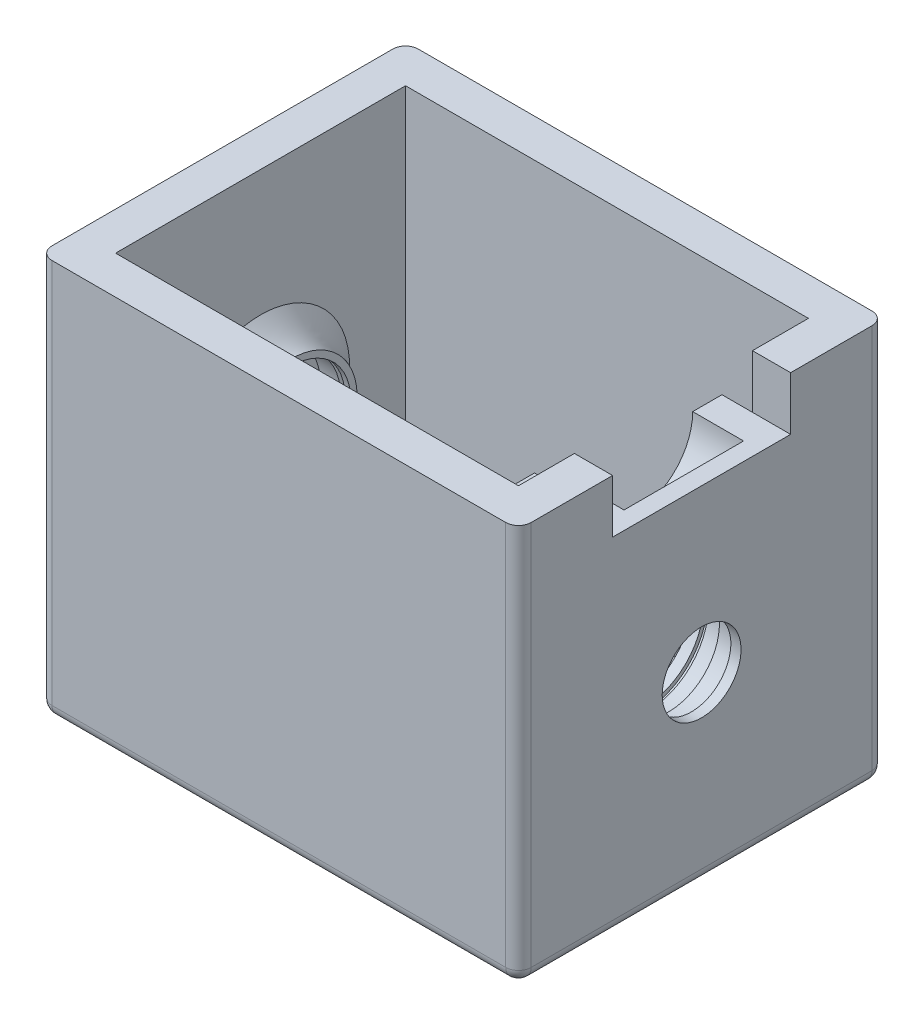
ISO-10303-21;
HEADER;
FILE_DESCRIPTION(('STEP AP214'),'2;1');
FILE_NAME('part.step','',(''),(''),'','','');
FILE_SCHEMA(('AUTOMOTIVE_DESIGN { 1 0 10303 214 1 1 1 1 }'));
ENDSEC;
DATA;
#1=APPLICATION_CONTEXT('core data for automotive mechanical design processes');
#2=APPLICATION_PROTOCOL_DEFINITION('international standard','automotive_design',2000,#1);
#3=PRODUCT_CONTEXT('',#1,'mechanical');
#4=PRODUCT('Part','Part','',(#3));
#5=PRODUCT_RELATED_PRODUCT_CATEGORY('part','',(#4));
#6=PRODUCT_DEFINITION_FORMATION('','',#4);
#7=PRODUCT_DEFINITION_CONTEXT('part definition',#1,'design');
#8=PRODUCT_DEFINITION('design','',#6,#7);
#9=PRODUCT_DEFINITION_SHAPE('','',#8);
#10=(LENGTH_UNIT() NAMED_UNIT(*) SI_UNIT(.MILLI.,.METRE.));
#11=(NAMED_UNIT(*) PLANE_ANGLE_UNIT() SI_UNIT($,.RADIAN.));
#12=(NAMED_UNIT(*) SI_UNIT($,.STERADIAN.) SOLID_ANGLE_UNIT());
#13=UNCERTAINTY_MEASURE_WITH_UNIT(LENGTH_MEASURE(1.E-05),#10,'distance_accuracy_value','');
#14=(GEOMETRIC_REPRESENTATION_CONTEXT(3) GLOBAL_UNCERTAINTY_ASSIGNED_CONTEXT((#13)) GLOBAL_UNIT_ASSIGNED_CONTEXT((#10,
#11,#12)) REPRESENTATION_CONTEXT('',''));
#15=CARTESIAN_POINT('',(0.,0.,0.));
#16=DIRECTION('',(0.,0.,1.));
#17=DIRECTION('',(1.,0.,0.));
#18=AXIS2_PLACEMENT_3D('',#15,#16,#17);
#19=CARTESIAN_POINT('',(175.4,72.,72.));
#20=DIRECTION('',(-1.,0.,0.));
#21=DIRECTION('',(0.,0.,1.));
#22=AXIS2_PLACEMENT_3D('',#19,#20,#21);
#23=CYLINDRICAL_SURFACE('',#22,23.4999999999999);
#24=CARTESIAN_POINT('',(161.4,72.,72.));
#25=DIRECTION('',(-1.,0.,0.));
#26=DIRECTION('',(0.,0.,1.));
#27=AXIS2_PLACEMENT_3D('',#24,#25,#26);
#28=CIRCLE('',#27,23.4999999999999);
#29=CARTESIAN_POINT('',(161.4,72.,95.4999999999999));
#30=VERTEX_POINT('',#29);
#31=EDGE_CURVE('E696',#30,#30,#28,.T.);
#32=ORIENTED_EDGE('',*,*,#31,.T.);
#33=EDGE_LOOP('',(#32));
#34=FACE_BOUND('',#33,.T.);
#35=CARTESIAN_POINT('',(165.65,72.,72.));
#36=DIRECTION('',(1.,0.,0.));
#37=DIRECTION('',(0.,1.,0.));
#38=AXIS2_PLACEMENT_3D('',#35,#36,#37);
#39=CIRCLE('',#38,23.4999999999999);
#40=CARTESIAN_POINT('',(165.65,95.4999999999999,72.));
#41=VERTEX_POINT('',#40);
#42=EDGE_CURVE('E38',#41,#41,#39,.F.);
#43=ORIENTED_EDGE('',*,*,#42,.F.);
#44=EDGE_LOOP('',(#43));
#45=FACE_BOUND('',#44,.T.);
#46=ADVANCED_FACE('F34',(#34,#45),#23,.F.);
#47=CARTESIAN_POINT('',(173.4,0.,144.));
#48=DIRECTION('',(-1.,0.,0.));
#49=DIRECTION('',(0.,0.,1.));
#50=AXIS2_PLACEMENT_3D('',#47,#48,#49);
#51=PLANE('',#50);
#52=DIRECTION('',(0.,1.,0.));
#53=VECTOR('',#52,1.);
#54=CARTESIAN_POINT('',(173.4,-56.0211236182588,37.));
#55=LINE('',#54,#53);
#56=CARTESIAN_POINT('',(173.4,15.,37.));
#57=VERTEX_POINT('',#56);
#58=CARTESIAN_POINT('',(173.4,135.5,37.));
#59=VERTEX_POINT('',#58);
#60=EDGE_CURVE('E319',#57,#59,#55,.T.);
#61=ORIENTED_EDGE('',*,*,#60,.T.);
#62=DIRECTION('',(0.,1.,0.));
#63=VECTOR('',#62,1.);
#64=CARTESIAN_POINT('',(173.4,156.5,37.));
#65=LINE('',#64,#63);
#66=CARTESIAN_POINT('',(173.4,156.5,37.));
#67=VERTEX_POINT('',#66);
#68=EDGE_CURVE('E337',#59,#67,#65,.T.);
#69=ORIENTED_EDGE('',*,*,#68,.T.);
#70=DIRECTION('',(0.,0.,-1.));
#71=VECTOR('',#70,1.);
#72=CARTESIAN_POINT('',(173.4,156.5,144.));
#73=LINE('',#72,#71);
#74=CARTESIAN_POINT('',(173.4,156.5,15.));
#75=VERTEX_POINT('',#74);
#76=EDGE_CURVE('E595',#67,#75,#73,.T.);
#77=ORIENTED_EDGE('',*,*,#76,.T.);
#78=DIRECTION('',(0.,1.,0.));
#79=VECTOR('',#78,1.);
#80=CARTESIAN_POINT('',(173.4,156.5,15.));
#81=LINE('',#80,#79);
#82=CARTESIAN_POINT('',(173.4,15.,15.));
#83=VERTEX_POINT('',#82);
#84=EDGE_CURVE('E581',#83,#75,#81,.T.);
#85=ORIENTED_EDGE('',*,*,#84,.F.);
#86=DIRECTION('',(0.,0.,-1.));
#87=VECTOR('',#86,1.);
#88=CARTESIAN_POINT('',(173.4,15.,144.));
#89=LINE('',#88,#87);
#90=EDGE_CURVE('E584',#57,#83,#89,.T.);
#91=ORIENTED_EDGE('',*,*,#90,.F.);
#92=EDGE_LOOP('',(#61,#69,#77,#85,#91));
#93=FACE_BOUND('',#92,.T.);
#94=ADVANCED_FACE('F716',(#93),#51,.T.);
#95=CARTESIAN_POINT('',(99.7,72.,107.));
#96=DIRECTION('',(0.,-1.,0.));
#97=DIRECTION('',(0.,0.,-1.));
#98=AXIS2_PLACEMENT_3D('',#95,#96,#97);
#99=PLANE('',#98);
#100=DIRECTION('',(0.,0.,1.));
#101=VECTOR('',#100,1.);
#102=CARTESIAN_POINT('',(129.7,72.,37.));
#103=LINE('',#102,#101);
#104=CARTESIAN_POINT('',(129.7,72.,95.5));
#105=VERTEX_POINT('',#104);
#106=CARTESIAN_POINT('',(129.7,72.,107.));
#107=VERTEX_POINT('',#106);
#108=EDGE_CURVE('E398',#105,#107,#103,.T.);
#109=ORIENTED_EDGE('',*,*,#108,.F.);
#110=DIRECTION('',(-1.,0.,0.));
#111=VECTOR('',#110,1.);
#112=CARTESIAN_POINT('',(188.401,72.,95.5));
#113=LINE('',#112,#111);
#114=CARTESIAN_POINT('',(119.7,72.,95.5));
#115=VERTEX_POINT('',#114);
#116=EDGE_CURVE('E387',#115,#105,#113,.F.);
#117=ORIENTED_EDGE('',*,*,#116,.F.);
#118=DIRECTION('',(0.,0.,-1.));
#119=VECTOR('',#118,1.);
#120=CARTESIAN_POINT('',(119.7,72.,37.));
#121=LINE('',#120,#119);
#122=CARTESIAN_POINT('',(119.7,72.,107.));
#123=VERTEX_POINT('',#122);
#124=EDGE_CURVE('E402',#123,#115,#121,.T.);
#125=ORIENTED_EDGE('',*,*,#124,.F.);
#126=DIRECTION('',(-1.,0.,0.));
#127=VECTOR('',#126,1.);
#128=CARTESIAN_POINT('',(119.7,72.,107.));
#129=LINE('',#128,#127);
#130=EDGE_CURVE('E397',#107,#123,#129,.T.);
#131=ORIENTED_EDGE('',*,*,#130,.F.);
#132=EDGE_LOOP('',(#109,#117,#125,#131));
#133=FACE_BOUND('',#132,.T.);
#134=ADVANCED_FACE('F723',(#133),#99,.F.);
#135=CARTESIAN_POINT('',(0.,15.,144.));
#136=DIRECTION('',(0.,1.,0.));
#137=DIRECTION('',(0.,0.,1.));
#138=AXIS2_PLACEMENT_3D('',#135,#136,#137);
#139=PLANE('',#138);
#140=DIRECTION('',(1.,0.,0.));
#141=VECTOR('',#140,1.);
#142=CARTESIAN_POINT('',(161.4,15.,37.));
#143=LINE('',#142,#141);
#144=CARTESIAN_POINT('',(161.4,15.,37.));
#145=VERTEX_POINT('',#144);
#146=EDGE_CURVE('E306',#145,#57,#143,.T.);
#147=ORIENTED_EDGE('',*,*,#146,.T.);
#148=ORIENTED_EDGE('',*,*,#90,.T.);
#149=DIRECTION('',(1.,0.,0.));
#150=VECTOR('',#149,1.);
#151=CARTESIAN_POINT('',(0.,15.,15.));
#152=LINE('',#151,#150);
#153=CARTESIAN_POINT('',(15.,15.,15.));
#154=VERTEX_POINT('',#153);
#155=EDGE_CURVE('E568',#154,#83,#152,.T.);
#156=ORIENTED_EDGE('',*,*,#155,.F.);
#157=DIRECTION('',(0.,0.,-1.));
#158=VECTOR('',#157,1.);
#159=CARTESIAN_POINT('',(15.,15.,144.));
#160=LINE('',#159,#158);
#161=CARTESIAN_POINT('',(15.,15.,129.));
#162=VERTEX_POINT('',#161);
#163=EDGE_CURVE('E569',#162,#154,#160,.T.);
#164=ORIENTED_EDGE('',*,*,#163,.F.);
#165=DIRECTION('',(1.,0.,0.));
#166=VECTOR('',#165,1.);
#167=CARTESIAN_POINT('',(0.,15.,129.));
#168=LINE('',#167,#166);
#169=CARTESIAN_POINT('',(173.4,15.,129.));
#170=VERTEX_POINT('',#169);
#171=EDGE_CURVE('E577',#162,#170,#168,.T.);
#172=ORIENTED_EDGE('',*,*,#171,.T.);
#173=CARTESIAN_POINT('',(173.4,15.,107.));
#174=VERTEX_POINT('',#173);
#175=EDGE_CURVE('E573',#170,#174,#89,.T.);
#176=ORIENTED_EDGE('',*,*,#175,.T.);
#177=DIRECTION('',(-1.,0.,0.));
#178=VECTOR('',#177,1.);
#179=CARTESIAN_POINT('',(161.4,15.,107.));
#180=LINE('',#179,#178);
#181=CARTESIAN_POINT('',(161.4,15.,107.));
#182=VERTEX_POINT('',#181);
#183=EDGE_CURVE('E310',#174,#182,#180,.T.);
#184=ORIENTED_EDGE('',*,*,#183,.T.);
#185=DIRECTION('',(0.,0.,-1.));
#186=VECTOR('',#185,1.);
#187=CARTESIAN_POINT('',(161.4,15.,107.));
#188=LINE('',#187,#186);
#189=EDGE_CURVE('E59',#182,#145,#188,.T.);
#190=ORIENTED_EDGE('',*,*,#189,.T.);
#191=EDGE_LOOP('',(#147,#148,#156,#164,#172,#176,#184,#190));
#192=FACE_BOUND('',#191,.T.);
#193=DIRECTION('',(-1.,0.,0.));
#194=VECTOR('',#193,1.);
#195=CARTESIAN_POINT('',(99.7,15.,37.));
#196=LINE('',#195,#194);
#197=CARTESIAN_POINT('',(99.7,15.,37.));
#198=VERTEX_POINT('',#197);
#199=CARTESIAN_POINT('',(87.7,15.,37.));
#200=VERTEX_POINT('',#199);
#201=EDGE_CURVE('E460',#198,#200,#196,.T.);
#202=ORIENTED_EDGE('',*,*,#201,.F.);
#203=DIRECTION('',(0.,0.,-1.));
#204=VECTOR('',#203,1.);
#205=CARTESIAN_POINT('',(99.7,15.,37.));
#206=LINE('',#205,#204);
#207=CARTESIAN_POINT('',(99.7,15.,107.));
#208=VERTEX_POINT('',#207);
#209=EDGE_CURVE('E457',#208,#198,#206,.T.);
#210=ORIENTED_EDGE('',*,*,#209,.F.);
#211=DIRECTION('',(1.,0.,0.));
#212=VECTOR('',#211,1.);
#213=CARTESIAN_POINT('',(99.7,15.,107.));
#214=LINE('',#213,#212);
#215=CARTESIAN_POINT('',(87.7,15.,107.));
#216=VERTEX_POINT('',#215);
#217=EDGE_CURVE('E465',#216,#208,#214,.T.);
#218=ORIENTED_EDGE('',*,*,#217,.F.);
#219=DIRECTION('',(0.,0.,1.));
#220=VECTOR('',#219,1.);
#221=CARTESIAN_POINT('',(87.7,15.,37.));
#222=LINE('',#221,#220);
#223=EDGE_CURVE('E462',#200,#216,#222,.T.);
#224=ORIENTED_EDGE('',*,*,#223,.F.);
#225=EDGE_LOOP('',(#202,#210,#218,#224));
#226=FACE_BOUND('',#225,.T.);
#227=DIRECTION('',(0.,0.,1.));
#228=VECTOR('',#227,1.);
#229=CARTESIAN_POINT('',(119.7,15.,37.));
#230=LINE('',#229,#228);
#231=CARTESIAN_POINT('',(119.7,15.,37.));
#232=VERTEX_POINT('',#231);
#233=CARTESIAN_POINT('',(119.7,15.,107.));
#234=VERTEX_POINT('',#233);
#235=EDGE_CURVE('E393',#232,#234,#230,.T.);
#236=ORIENTED_EDGE('',*,*,#235,.F.);
#237=DIRECTION('',(-1.,0.,0.));
#238=VECTOR('',#237,1.);
#239=CARTESIAN_POINT('',(119.7,15.,37.));
#240=LINE('',#239,#238);
#241=CARTESIAN_POINT('',(129.7,15.,37.));
#242=VERTEX_POINT('',#241);
#243=EDGE_CURVE('E414',#242,#232,#240,.T.);
#244=ORIENTED_EDGE('',*,*,#243,.F.);
#245=DIRECTION('',(0.,0.,-1.));
#246=VECTOR('',#245,1.);
#247=CARTESIAN_POINT('',(129.7,15.,37.));
#248=LINE('',#247,#246);
#249=CARTESIAN_POINT('',(129.7,15.,107.));
#250=VERTEX_POINT('',#249);
#251=EDGE_CURVE('E411',#250,#242,#248,.T.);
#252=ORIENTED_EDGE('',*,*,#251,.F.);
#253=DIRECTION('',(1.,0.,0.));
#254=VECTOR('',#253,1.);
#255=CARTESIAN_POINT('',(119.7,15.,107.));
#256=LINE('',#255,#254);
#257=EDGE_CURVE('E408',#234,#250,#256,.T.);
#258=ORIENTED_EDGE('',*,*,#257,.F.);
#259=EDGE_LOOP('',(#236,#244,#252,#258));
#260=FACE_BOUND('',#259,.T.);
#261=ADVANCED_FACE('F983',(#192,#226,#260),#139,.T.);
#262=CARTESIAN_POINT('',(188.401,72.,72.));
#263=DIRECTION('',(-1.,0.,0.));
#264=DIRECTION('',(0.,0.,1.));
#265=AXIS2_PLACEMENT_3D('',#262,#263,#264);
#266=CYLINDRICAL_SURFACE('',#265,21.);
#267=CARTESIAN_POINT('',(97.6999999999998,72.,72.));
#268=DIRECTION('',(-1.,0.,0.));
#269=DIRECTION('',(0.,0.,1.));
#270=AXIS2_PLACEMENT_3D('',#267,#268,#269);
#271=CIRCLE('',#270,21.);
#272=CARTESIAN_POINT('',(97.6999999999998,72.,93.));
#273=VERTEX_POINT('',#272);
#274=CARTESIAN_POINT('',(97.6999999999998,72.,51.));
#275=VERTEX_POINT('',#274);
#276=EDGE_CURVE('E614',#273,#275,#271,.F.);
#277=ORIENTED_EDGE('',*,*,#276,.F.);
#278=DIRECTION('',(-1.,0.,0.));
#279=VECTOR('',#278,1.);
#280=CARTESIAN_POINT('',(188.401,72.,93.));
#281=LINE('',#280,#279);
#282=CARTESIAN_POINT('',(99.7,72.,93.));
#283=VERTEX_POINT('',#282);
#284=EDGE_CURVE('E449',#273,#283,#281,.F.);
#285=ORIENTED_EDGE('',*,*,#284,.T.);
#286=CARTESIAN_POINT('',(99.7,72.,72.));
#287=DIRECTION('',(-1.,0.,0.));
#288=DIRECTION('',(0.,0.,1.));
#289=AXIS2_PLACEMENT_3D('',#286,#287,#288);
#290=CIRCLE('',#289,21.);
#291=CARTESIAN_POINT('',(99.7,72.,51.));
#292=VERTEX_POINT('',#291);
#293=EDGE_CURVE('E455',#283,#292,#290,.F.);
#294=ORIENTED_EDGE('',*,*,#293,.T.);
#295=DIRECTION('',(-1.,0.,0.));
#296=VECTOR('',#295,1.);
#297=CARTESIAN_POINT('',(188.401,72.,51.));
#298=LINE('',#297,#296);
#299=EDGE_CURVE('E446',#292,#275,#298,.T.);
#300=ORIENTED_EDGE('',*,*,#299,.T.);
#301=EDGE_LOOP('',(#277,#285,#294,#300));
#302=FACE_BOUND('',#301,.T.);
#303=ADVANCED_FACE('F926',(#302),#266,.F.);
#304=CARTESIAN_POINT('',(99.7,72.,107.));
#305=DIRECTION('',(0.,-1.,0.));
#306=DIRECTION('',(0.,0.,-1.));
#307=AXIS2_PLACEMENT_3D('',#304,#305,#306);
#308=PLANE('',#307);
#309=DIRECTION('',(1.,0.,0.));
#310=VECTOR('',#309,1.);
#311=CARTESIAN_POINT('',(89.7,72.,95.5));
#312=LINE('',#311,#310);
#313=CARTESIAN_POINT('',(89.7,72.,95.5));
#314=VERTEX_POINT('',#313);
#315=CARTESIAN_POINT('',(97.7,72.,95.5));
#316=VERTEX_POINT('',#315);
#317=EDGE_CURVE('E443',#314,#316,#312,.T.);
#318=ORIENTED_EDGE('',*,*,#317,.F.);
#319=DIRECTION('',(0.,0.,-1.));
#320=VECTOR('',#319,1.);
#321=CARTESIAN_POINT('',(89.6999999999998,72.,107.));
#322=LINE('',#321,#320);
#323=CARTESIAN_POINT('',(89.6999999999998,72.,93.));
#324=VERTEX_POINT('',#323);
#325=EDGE_CURVE('E440',#314,#324,#322,.T.);
#326=ORIENTED_EDGE('',*,*,#325,.T.);
#327=CARTESIAN_POINT('',(87.7,72.,93.));
#328=VERTEX_POINT('',#327);
#329=EDGE_CURVE('E450',#328,#324,#281,.F.);
#330=ORIENTED_EDGE('',*,*,#329,.F.);
#331=DIRECTION('',(0.,0.,1.));
#332=VECTOR('',#331,1.);
#333=CARTESIAN_POINT('',(87.7,72.,37.));
#334=LINE('',#333,#332);
#335=CARTESIAN_POINT('',(87.7,72.,107.));
#336=VERTEX_POINT('',#335);
#337=EDGE_CURVE('E473',#328,#336,#334,.T.);
#338=ORIENTED_EDGE('',*,*,#337,.T.);
#339=DIRECTION('',(1.,0.,0.));
#340=VECTOR('',#339,1.);
#341=CARTESIAN_POINT('',(99.7,72.,107.));
#342=LINE('',#341,#340);
#343=CARTESIAN_POINT('',(99.7,72.,107.));
#344=VERTEX_POINT('',#343);
#345=EDGE_CURVE('E477',#336,#344,#342,.T.);
#346=ORIENTED_EDGE('',*,*,#345,.T.);
#347=DIRECTION('',(0.,0.,-1.));
#348=VECTOR('',#347,1.);
#349=CARTESIAN_POINT('',(99.7,72.,37.));
#350=LINE('',#349,#348);
#351=EDGE_CURVE('E468',#344,#283,#350,.T.);
#352=ORIENTED_EDGE('',*,*,#351,.T.);
#353=ORIENTED_EDGE('',*,*,#284,.F.);
#354=DIRECTION('',(0.,0.,-1.));
#355=VECTOR('',#354,1.);
#356=CARTESIAN_POINT('',(97.6999999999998,72.,107.));
#357=LINE('',#356,#355);
#358=EDGE_CURVE('E435',#316,#273,#357,.T.);
#359=ORIENTED_EDGE('',*,*,#358,.F.);
#360=EDGE_LOOP('',(#318,#326,#330,#338,#346,#352,#353,#359));
#361=FACE_BOUND('',#360,.T.);
#362=ADVANCED_FACE('F931',(#361),#308,.F.);
#363=CARTESIAN_POINT('',(-51.4680374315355,72.,72.));
#364=DIRECTION('',(1.,0.,0.));
#365=DIRECTION('',(0.,0.,-1.));
#366=AXIS2_PLACEMENT_3D('',#363,#364,#365);
#367=CYLINDRICAL_SURFACE('',#366,23.5);
#368=CARTESIAN_POINT('',(27.,72.,72.));
#369=DIRECTION('',(1.,0.,0.));
#370=DIRECTION('',(0.,0.,-1.));
#371=AXIS2_PLACEMENT_3D('',#368,#369,#370);
#372=CIRCLE('',#371,23.5);
#373=CARTESIAN_POINT('',(27.,72.,48.5));
#374=VERTEX_POINT('',#373);
#375=EDGE_CURVE('E496',#374,#374,#372,.T.);
#376=CARTESIAN_POINT('',(24.75,72.,72.));
#377=DIRECTION('',(-1.,0.,0.));
#378=DIRECTION('',(0.,0.,1.));
#379=AXIS2_PLACEMENT_3D('',#376,#377,#378);
#380=CIRCLE('',#379,23.5);
#381=CARTESIAN_POINT('',(24.75,72.,48.5));
#382=VERTEX_POINT('',#381);
#383=EDGE_CURVE('E500',#382,#382,#380,.F.);
#384=CARTESIAN_POINT('',(27.,72.,48.5));
#385=CARTESIAN_POINT('',(26.9765625,72.,48.5));
#386=CARTESIAN_POINT('',(26.953125,72.,48.5));
#387=CARTESIAN_POINT('',(26.90625,72.,48.5));
#388=CARTESIAN_POINT('',(26.8828125,72.,48.5));
#389=CARTESIAN_POINT('',(26.8359375,72.,48.5));
#390=CARTESIAN_POINT('',(26.8125,72.,48.5));
#391=CARTESIAN_POINT('',(26.765625,72.,48.5));
#392=CARTESIAN_POINT('',(26.7421875,72.,48.5));
#393=CARTESIAN_POINT('',(26.6953125,72.,48.5));
#394=CARTESIAN_POINT('',(26.671875,72.,48.5));
#395=CARTESIAN_POINT('',(26.625,72.,48.5));
#396=CARTESIAN_POINT('',(26.6015625,72.,48.5));
#397=CARTESIAN_POINT('',(26.5546875,72.,48.5));
#398=CARTESIAN_POINT('',(26.53125,72.,48.5));
#399=CARTESIAN_POINT('',(26.484375,72.,48.5));
#400=CARTESIAN_POINT('',(26.4609375,72.,48.5));
#401=CARTESIAN_POINT('',(26.4140625,72.,48.5));
#402=CARTESIAN_POINT('',(26.390625,72.,48.5));
#403=CARTESIAN_POINT('',(26.34375,72.,48.5));
#404=CARTESIAN_POINT('',(26.3203125,72.,48.5));
#405=CARTESIAN_POINT('',(26.2734375,72.,48.5));
#406=CARTESIAN_POINT('',(26.25,72.,48.5));
#407=CARTESIAN_POINT('',(26.203125,72.,48.5));
#408=CARTESIAN_POINT('',(26.1796875,72.,48.5));
#409=CARTESIAN_POINT('',(26.1328125,72.,48.5));
#410=CARTESIAN_POINT('',(26.109375,72.,48.5));
#411=CARTESIAN_POINT('',(26.0625,72.,48.5));
#412=CARTESIAN_POINT('',(26.0390625,72.,48.5));
#413=CARTESIAN_POINT('',(25.9921875,72.,48.5));
#414=CARTESIAN_POINT('',(25.96875,72.,48.5));
#415=CARTESIAN_POINT('',(25.921875,72.,48.5));
#416=CARTESIAN_POINT('',(25.8984375,72.,48.5));
#417=CARTESIAN_POINT('',(25.8515625,72.,48.5));
#418=CARTESIAN_POINT('',(25.828125,72.,48.5));
#419=CARTESIAN_POINT('',(25.78125,72.,48.5));
#420=CARTESIAN_POINT('',(25.7578125,72.,48.5));
#421=CARTESIAN_POINT('',(25.7109375,72.,48.5));
#422=CARTESIAN_POINT('',(25.6875,72.,48.5));
#423=CARTESIAN_POINT('',(25.640625,72.,48.5));
#424=CARTESIAN_POINT('',(25.6171875,72.,48.5));
#425=CARTESIAN_POINT('',(25.5703125,72.,48.5));
#426=CARTESIAN_POINT('',(25.546875,72.,48.5));
#427=CARTESIAN_POINT('',(25.5,72.,48.5));
#428=CARTESIAN_POINT('',(25.4765625,72.,48.5));
#429=CARTESIAN_POINT('',(25.4296875,72.,48.5));
#430=CARTESIAN_POINT('',(25.40625,72.,48.5));
#431=CARTESIAN_POINT('',(25.359375,72.,48.5));
#432=CARTESIAN_POINT('',(25.3359375,72.,48.5));
#433=CARTESIAN_POINT('',(25.2890625,72.,48.5));
#434=CARTESIAN_POINT('',(25.265625,72.,48.5));
#435=CARTESIAN_POINT('',(25.21875,72.,48.5));
#436=CARTESIAN_POINT('',(25.1953125,72.,48.5));
#437=CARTESIAN_POINT('',(25.1484375,72.,48.5));
#438=CARTESIAN_POINT('',(25.125,72.,48.5));
#439=CARTESIAN_POINT('',(25.078125,72.,48.5));
#440=CARTESIAN_POINT('',(25.0546875,72.,48.5));
#441=CARTESIAN_POINT('',(25.0078125,72.,48.5));
#442=CARTESIAN_POINT('',(24.984375,72.,48.5));
#443=CARTESIAN_POINT('',(24.9375,72.,48.5));
#444=CARTESIAN_POINT('',(24.9140625,72.,48.5));
#445=CARTESIAN_POINT('',(24.8671875,72.,48.5));
#446=CARTESIAN_POINT('',(24.84375,72.,48.5));
#447=CARTESIAN_POINT('',(24.796875,72.,48.5));
#448=CARTESIAN_POINT('',(24.7734375,72.,48.5));
#449=CARTESIAN_POINT('',(24.75,72.,48.5));
#450=B_SPLINE_CURVE_WITH_KNOTS('',3,(#384,#385,#386,#387,#388,#389,#390,#391,#392,#393,#394,
#395,#396,#397,#398,#399,#400,#401,#402,#403,#404,#405,#406,#407,#408,#409,#410,#411,#412,#413,
#414,#415,#416,#417,#418,#419,#420,#421,#422,#423,#424,#425,#426,#427,#428,#429,#430,#431,#432,
#433,#434,#435,#436,#437,#438,#439,#440,#441,#442,#443,#444,#445,#446,#447,#448,#449),
.UNSPECIFIED.,.F.,.F.,(4,2,2,2,2,2,2,2,2,2,2,2,2,2,2,2,2,2,2,2,2,2,2,2,2,2,2,2,2,2,2,2,4),(0.,
0.0703125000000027,0.140625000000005,0.210937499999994,0.281249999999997,0.351562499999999,
0.421874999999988,0.492187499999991,0.562499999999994,0.632812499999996,0.703124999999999,
0.773437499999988,0.84374999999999,0.914062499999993,0.984374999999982,1.05468749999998,
1.12499999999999,1.19531249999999,1.26562499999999,1.33593749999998,1.40624999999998,
1.47656249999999,1.54687499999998,1.61718749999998,1.68749999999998,1.75781249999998,
1.82812499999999,1.89843749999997,1.96874999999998,2.03906249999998,2.10937499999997,
2.17968749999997,2.24999999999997),.UNSPECIFIED.);
#451=EDGE_CURVE('BSEAM964',#374,#382,#450,.T.);
#452=ORIENTED_EDGE('',*,*,#375,.T.);
#453=ORIENTED_EDGE('',*,*,#383,.F.);
#454=ORIENTED_EDGE('',*,*,#451,.T.);
#455=ORIENTED_EDGE('',*,*,#451,.F.);
#456=EDGE_LOOP('',(#452,#454,#453,#455));
#457=FACE_BOUND('',#456,.T.);
#458=ADVANCED_FACE('F964',(#457),#367,.F.);
#459=CARTESIAN_POINT('',(15.,0.,144.));
#460=DIRECTION('',(1.,0.,0.));
#461=DIRECTION('',(0.,0.,-1.));
#462=AXIS2_PLACEMENT_3D('',#459,#460,#461);
#463=PLANE('',#462);
#464=DIRECTION('',(0.,-1.,0.));
#465=VECTOR('',#464,1.);
#466=CARTESIAN_POINT('',(15.,156.5,15.));
#467=LINE('',#466,#465);
#468=CARTESIAN_POINT('',(15.,156.5,15.));
#469=VERTEX_POINT('',#468);
#470=EDGE_CURVE('E565',#469,#154,#467,.T.);
#471=ORIENTED_EDGE('',*,*,#470,.F.);
#472=DIRECTION('',(0.,0.,-1.));
#473=VECTOR('',#472,1.);
#474=CARTESIAN_POINT('',(15.,156.5,144.));
#475=LINE('',#474,#473);
#476=CARTESIAN_POINT('',(15.,156.5,129.));
#477=VERTEX_POINT('',#476);
#478=EDGE_CURVE('E592',#477,#469,#475,.T.);
#479=ORIENTED_EDGE('',*,*,#478,.F.);
#480=DIRECTION('',(0.,-1.,0.));
#481=VECTOR('',#480,1.);
#482=CARTESIAN_POINT('',(15.,156.5,129.));
#483=LINE('',#482,#481);
#484=EDGE_CURVE('E574',#477,#162,#483,.T.);
#485=ORIENTED_EDGE('',*,*,#484,.T.);
#486=ORIENTED_EDGE('',*,*,#163,.T.);
#487=EDGE_LOOP('',(#471,#479,#485,#486));
#488=FACE_BOUND('',#487,.T.);
#489=CARTESIAN_POINT('',(15.,72.,72.));
#490=DIRECTION('',(1.,0.,0.));
#491=DIRECTION('',(0.,0.,-1.));
#492=AXIS2_PLACEMENT_3D('',#489,#490,#491);
#493=CIRCLE('',#492,35.);
#494=CARTESIAN_POINT('',(15.,106.893825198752,74.7241444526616));
#495=VERTEX_POINT('',#494);
#496=EDGE_CURVE('E506',#495,#495,#493,.T.);
#497=ORIENTED_EDGE('',*,*,#496,.F.);
#498=EDGE_LOOP('',(#497));
#499=FACE_BOUND('',#498,.T.);
#500=ADVANCED_FACE('F799',(#488,#499),#463,.T.);
#501=CARTESIAN_POINT('',(188.401,72.,72.));
#502=DIRECTION('',(-1.,0.,0.));
#503=DIRECTION('',(0.,0.,1.));
#504=AXIS2_PLACEMENT_3D('',#501,#502,#503);
#505=CYLINDRICAL_SURFACE('',#504,15.5);
#506=CARTESIAN_POINT('',(0.,72.,72.));
#507=DIRECTION('',(-1.,0.,0.));
#508=DIRECTION('',(0.,0.,1.));
#509=AXIS2_PLACEMENT_3D('',#506,#507,#508);
#510=CIRCLE('',#509,15.5);
#511=CARTESIAN_POINT('',(0.,72.,87.5));
#512=VERTEX_POINT('',#511);
#513=EDGE_CURVE('E562',#512,#512,#510,.T.);
#514=ORIENTED_EDGE('',*,*,#513,.T.);
#515=EDGE_LOOP('',(#514));
#516=FACE_BOUND('',#515,.T.);
#517=CARTESIAN_POINT('',(3.,72.,72.));
#518=DIRECTION('',(1.,0.,0.));
#519=DIRECTION('',(0.,0.,-1.));
#520=AXIS2_PLACEMENT_3D('',#517,#518,#519);
#521=CIRCLE('',#520,15.5);
#522=CARTESIAN_POINT('',(3.,72.,56.5));
#523=VERTEX_POINT('',#522);
#524=EDGE_CURVE('E561',#523,#523,#521,.F.);
#525=ORIENTED_EDGE('',*,*,#524,.F.);
#526=EDGE_LOOP('',(#525));
#527=FACE_BOUND('',#526,.T.);
#528=ADVANCED_FACE('F978',(#516,#527),#505,.F.);
#529=CARTESIAN_POINT('',(0.,156.5,144.));
#530=DIRECTION('',(0.,-1.,0.));
#531=DIRECTION('',(0.,0.,-1.));
#532=AXIS2_PLACEMENT_3D('',#529,#530,#531);
#533=PLANE('',#532);
#534=DIRECTION('',(0.,0.,-1.));
#535=VECTOR('',#534,1.);
#536=CARTESIAN_POINT('',(188.4,156.5,144.));
#537=LINE('',#536,#535);
#538=CARTESIAN_POINT('',(188.4,156.5,139.));
#539=VERTEX_POINT('',#538);
#540=CARTESIAN_POINT('',(188.4,156.5,107.));
#541=VERTEX_POINT('',#540);
#542=EDGE_CURVE('E611',#539,#541,#537,.T.);
#543=ORIENTED_EDGE('',*,*,#542,.T.);
#544=DIRECTION('',(1.,0.,0.));
#545=VECTOR('',#544,1.);
#546=CARTESIAN_POINT('',(-0.001000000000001,156.5,107.));
#547=LINE('',#546,#545);
#548=CARTESIAN_POINT('',(173.4,156.5,107.));
#549=VERTEX_POINT('',#548);
#550=EDGE_CURVE('E332',#549,#541,#547,.T.);
#551=ORIENTED_EDGE('',*,*,#550,.F.);
#552=CARTESIAN_POINT('',(173.4,156.5,129.));
#553=VERTEX_POINT('',#552);
#554=EDGE_CURVE('E598',#553,#549,#73,.T.);
#555=ORIENTED_EDGE('',*,*,#554,.F.);
#556=DIRECTION('',(-1.,0.,0.));
#557=VECTOR('',#556,1.);
#558=CARTESIAN_POINT('',(0.,156.5,129.));
#559=LINE('',#558,#557);
#560=EDGE_CURVE('E591',#553,#477,#559,.T.);
#561=ORIENTED_EDGE('',*,*,#560,.T.);
#562=ORIENTED_EDGE('',*,*,#478,.T.);
#563=DIRECTION('',(-1.,0.,0.));
#564=VECTOR('',#563,1.);
#565=CARTESIAN_POINT('',(0.,156.5,15.));
#566=LINE('',#565,#564);
#567=EDGE_CURVE('E578',#75,#469,#566,.T.);
#568=ORIENTED_EDGE('',*,*,#567,.F.);
#569=ORIENTED_EDGE('',*,*,#76,.F.);
#570=DIRECTION('',(1.,0.,0.));
#571=VECTOR('',#570,1.);
#572=CARTESIAN_POINT('',(-0.001000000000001,156.5,37.));
#573=LINE('',#572,#571);
#574=CARTESIAN_POINT('',(188.4,156.5,37.));
#575=VERTEX_POINT('',#574);
#576=EDGE_CURVE('E340',#67,#575,#573,.T.);
#577=ORIENTED_EDGE('',*,*,#576,.T.);
#578=CARTESIAN_POINT('',(188.4,156.5,5.));
#579=VERTEX_POINT('',#578);
#580=EDGE_CURVE('E610',#575,#579,#537,.T.);
#581=ORIENTED_EDGE('',*,*,#580,.T.);
#582=CARTESIAN_POINT('',(183.4,156.5,5.));
#583=DIRECTION('',(0.,-1.,0.));
#584=DIRECTION('',(0.,0.,-1.));
#585=AXIS2_PLACEMENT_3D('',#582,#583,#584);
#586=CIRCLE('',#585,5.);
#587=CARTESIAN_POINT('',(183.4,156.5,0.));
#588=VERTEX_POINT('',#587);
#589=EDGE_CURVE('E664',#579,#588,#586,.F.);
#590=ORIENTED_EDGE('',*,*,#589,.T.);
#591=DIRECTION('',(-1.,0.,0.));
#592=VECTOR('',#591,1.);
#593=CARTESIAN_POINT('',(0.,156.5,0.));
#594=LINE('',#593,#592);
#595=CARTESIAN_POINT('',(5.,156.5,0.));
#596=VERTEX_POINT('',#595);
#597=EDGE_CURVE('E572',#588,#596,#594,.T.);
#598=ORIENTED_EDGE('',*,*,#597,.T.);
#599=CARTESIAN_POINT('',(5.,156.5,5.));
#600=DIRECTION('',(0.,-1.,0.));
#601=DIRECTION('',(0.,0.,-1.));
#602=AXIS2_PLACEMENT_3D('',#599,#600,#601);
#603=CIRCLE('',#602,5.);
#604=CARTESIAN_POINT('',(0.,156.5,5.));
#605=VERTEX_POINT('',#604);
#606=EDGE_CURVE('E666',#596,#605,#603,.F.);
#607=ORIENTED_EDGE('',*,*,#606,.T.);
#608=DIRECTION('',(0.,0.,-1.));
#609=VECTOR('',#608,1.);
#610=CARTESIAN_POINT('',(0.,156.5,144.));
#611=LINE('',#610,#609);
#612=CARTESIAN_POINT('',(0.,156.5,139.));
#613=VERTEX_POINT('',#612);
#614=EDGE_CURVE('E607',#613,#605,#611,.T.);
#615=ORIENTED_EDGE('',*,*,#614,.F.);
#616=CARTESIAN_POINT('',(5.,156.5,139.));
#617=DIRECTION('',(0.,-1.,0.));
#618=DIRECTION('',(0.,0.,-1.));
#619=AXIS2_PLACEMENT_3D('',#616,#617,#618);
#620=CIRCLE('',#619,5.);
#621=CARTESIAN_POINT('',(5.,156.5,144.));
#622=VERTEX_POINT('',#621);
#623=EDGE_CURVE('E668',#613,#622,#620,.F.);
#624=ORIENTED_EDGE('',*,*,#623,.T.);
#625=DIRECTION('',(-1.,0.,0.));
#626=VECTOR('',#625,1.);
#627=CARTESIAN_POINT('',(0.,156.5,144.));
#628=LINE('',#627,#626);
#629=CARTESIAN_POINT('',(183.4,156.5,144.));
#630=VERTEX_POINT('',#629);
#631=EDGE_CURVE('E604',#630,#622,#628,.T.);
#632=ORIENTED_EDGE('',*,*,#631,.F.);
#633=CARTESIAN_POINT('',(183.4,156.5,139.));
#634=DIRECTION('',(0.,-1.,0.));
#635=DIRECTION('',(0.,0.,-1.));
#636=AXIS2_PLACEMENT_3D('',#633,#634,#635);
#637=CIRCLE('',#636,5.);
#638=EDGE_CURVE('E662',#630,#539,#637,.F.);
#639=ORIENTED_EDGE('',*,*,#638,.T.);
#640=EDGE_LOOP('',(#543,#551,#555,#561,#562,#568,#569,#577,#581,#590,#598,#607,#615,#624,#632,#639));
#641=FACE_BOUND('',#640,.T.);
#642=ADVANCED_FACE('F788',(#641),#533,.F.);
#643=CARTESIAN_POINT('',(0.,0.,144.));
#644=DIRECTION('',(1.,0.,0.));
#645=DIRECTION('',(0.,0.,-1.));
#646=AXIS2_PLACEMENT_3D('',#643,#644,#645);
#647=PLANE('',#646);
#648=ORIENTED_EDGE('',*,*,#513,.F.);
#649=EDGE_LOOP('',(#648));
#650=FACE_BOUND('',#649,.T.);
#651=DIRECTION('',(0.,0.,-1.));
#652=VECTOR('',#651,1.);
#653=CARTESIAN_POINT('',(0.,5.,144.));
#654=LINE('',#653,#652);
#655=CARTESIAN_POINT('',(0.,5.,5.));
#656=VERTEX_POINT('',#655);
#657=CARTESIAN_POINT('',(0.,5.,139.));
#658=VERTEX_POINT('',#657);
#659=EDGE_CURVE('E638',#656,#658,#654,.F.);
#660=ORIENTED_EDGE('',*,*,#659,.T.);
#661=DIRECTION('',(0.,-1.,0.));
#662=VECTOR('',#661,1.);
#663=CARTESIAN_POINT('',(0.,0.,139.));
#664=LINE('',#663,#662);
#665=EDGE_CURVE('E641',#658,#613,#664,.F.);
#666=ORIENTED_EDGE('',*,*,#665,.T.);
#667=ORIENTED_EDGE('',*,*,#614,.T.);
#668=DIRECTION('',(0.,-1.,0.));
#669=VECTOR('',#668,1.);
#670=CARTESIAN_POINT('',(0.,0.,5.));
#671=LINE('',#670,#669);
#672=EDGE_CURVE('E636',#605,#656,#671,.T.);
#673=ORIENTED_EDGE('',*,*,#672,.T.);
#674=EDGE_LOOP('',(#660,#666,#667,#673));
#675=FACE_BOUND('',#674,.T.);
#676=ADVANCED_FACE('F36',(#650,#675),#647,.F.);
#677=CARTESIAN_POINT('',(0.,0.,144.));
#678=DIRECTION('',(0.,1.,0.));
#679=DIRECTION('',(0.,0.,1.));
#680=AXIS2_PLACEMENT_3D('',#677,#678,#679);
#681=PLANE('',#680);
#682=DIRECTION('',(1.,0.,0.));
#683=VECTOR('',#682,1.);
#684=CARTESIAN_POINT('',(0.,0.,139.));
#685=LINE('',#684,#683);
#686=CARTESIAN_POINT('',(183.4,0.,139.));
#687=VERTEX_POINT('',#686);
#688=CARTESIAN_POINT('',(5.,0.,139.));
#689=VERTEX_POINT('',#688);
#690=EDGE_CURVE('E631',#687,#689,#685,.F.);
#691=ORIENTED_EDGE('',*,*,#690,.T.);
#692=DIRECTION('',(0.,0.,-1.));
#693=VECTOR('',#692,1.);
#694=CARTESIAN_POINT('',(5.,0.,144.));
#695=LINE('',#694,#693);
#696=CARTESIAN_POINT('',(5.,0.,5.));
#697=VERTEX_POINT('',#696);
#698=EDGE_CURVE('E633',#689,#697,#695,.T.);
#699=ORIENTED_EDGE('',*,*,#698,.T.);
#700=DIRECTION('',(1.,0.,0.));
#701=VECTOR('',#700,1.);
#702=CARTESIAN_POINT('',(188.4,0.,5.));
#703=LINE('',#702,#701);
#704=CARTESIAN_POINT('',(183.4,0.,5.));
#705=VERTEX_POINT('',#704);
#706=EDGE_CURVE('E627',#697,#705,#703,.T.);
#707=ORIENTED_EDGE('',*,*,#706,.T.);
#708=DIRECTION('',(0.,0.,-1.));
#709=VECTOR('',#708,1.);
#710=CARTESIAN_POINT('',(183.4,0.,144.));
#711=LINE('',#710,#709);
#712=EDGE_CURVE('E629',#705,#687,#711,.F.);
#713=ORIENTED_EDGE('',*,*,#712,.T.);
#714=EDGE_LOOP('',(#691,#699,#707,#713));
#715=FACE_BOUND('',#714,.T.);
#716=ADVANCED_FACE('F774',(#715),#681,.F.);
#717=CARTESIAN_POINT('',(188.4,0.,144.));
#718=DIRECTION('',(-1.,0.,0.));
#719=DIRECTION('',(0.,0.,1.));
#720=AXIS2_PLACEMENT_3D('',#717,#718,#719);
#721=PLANE('',#720);
#722=CARTESIAN_POINT('',(188.4,72.,72.));
#723=DIRECTION('',(-1.,0.,0.));
#724=DIRECTION('',(0.,0.,1.));
#725=AXIS2_PLACEMENT_3D('',#722,#723,#724);
#726=CIRCLE('',#725,15.5);
#727=CARTESIAN_POINT('',(188.4,72.,87.5));
#728=VERTEX_POINT('',#727);
#729=EDGE_CURVE('E687',#728,#728,#726,.F.);
#730=ORIENTED_EDGE('',*,*,#729,.F.);
#731=EDGE_LOOP('',(#730));
#732=FACE_BOUND('',#731,.T.);
#733=DIRECTION('',(0.,0.,-1.));
#734=VECTOR('',#733,1.);
#735=CARTESIAN_POINT('',(188.4,135.5,37.));
#736=LINE('',#735,#734);
#737=CARTESIAN_POINT('',(188.4,135.5,107.));
#738=VERTEX_POINT('',#737);
#739=CARTESIAN_POINT('',(188.4,135.5,37.));
#740=VERTEX_POINT('',#739);
#741=EDGE_CURVE('E329',#738,#740,#736,.T.);
#742=ORIENTED_EDGE('',*,*,#741,.F.);
#743=DIRECTION('',(0.,-1.,0.));
#744=VECTOR('',#743,1.);
#745=CARTESIAN_POINT('',(188.4,135.5,107.));
#746=LINE('',#745,#744);
#747=EDGE_CURVE('E333',#541,#738,#746,.T.);
#748=ORIENTED_EDGE('',*,*,#747,.F.);
#749=ORIENTED_EDGE('',*,*,#542,.F.);
#750=DIRECTION('',(0.,1.,0.));
#751=VECTOR('',#750,1.);
#752=CARTESIAN_POINT('',(188.4,0.,139.));
#753=LINE('',#752,#751);
#754=CARTESIAN_POINT('',(188.4,5.,139.));
#755=VERTEX_POINT('',#754);
#756=EDGE_CURVE('E649',#539,#755,#753,.F.);
#757=ORIENTED_EDGE('',*,*,#756,.T.);
#758=DIRECTION('',(0.,0.,-1.));
#759=VECTOR('',#758,1.);
#760=CARTESIAN_POINT('',(188.4,5.,144.));
#761=LINE('',#760,#759);
#762=CARTESIAN_POINT('',(188.4,5.,5.));
#763=VERTEX_POINT('',#762);
#764=EDGE_CURVE('E651',#755,#763,#761,.T.);
#765=ORIENTED_EDGE('',*,*,#764,.T.);
#766=DIRECTION('',(0.,1.,0.));
#767=VECTOR('',#766,1.);
#768=CARTESIAN_POINT('',(188.4,156.5,5.));
#769=LINE('',#768,#767);
#770=EDGE_CURVE('E653',#763,#579,#769,.T.);
#771=ORIENTED_EDGE('',*,*,#770,.T.);
#772=ORIENTED_EDGE('',*,*,#580,.F.);
#773=DIRECTION('',(0.,1.,0.));
#774=VECTOR('',#773,1.);
#775=CARTESIAN_POINT('',(188.4,156.5,37.));
#776=LINE('',#775,#774);
#777=EDGE_CURVE('E328',#740,#575,#776,.T.);
#778=ORIENTED_EDGE('',*,*,#777,.F.);
#779=EDGE_LOOP('',(#742,#748,#749,#757,#765,#771,#772,#778));
#780=FACE_BOUND('',#779,.T.);
#781=ADVANCED_FACE('F770',(#732,#780),#721,.F.);
#782=CARTESIAN_POINT('',(0.,156.5,144.));
#783=DIRECTION('',(0.,0.,-1.));
#784=DIRECTION('',(-1.,0.,0.));
#785=AXIS2_PLACEMENT_3D('',#782,#783,#784);
#786=PLANE('',#785);
#787=ORIENTED_EDGE('',*,*,#631,.T.);
#788=DIRECTION('',(0.,-1.,0.));
#789=VECTOR('',#788,1.);
#790=CARTESIAN_POINT('',(5.,156.5,144.));
#791=LINE('',#790,#789);
#792=CARTESIAN_POINT('',(5.,5.,144.));
#793=VERTEX_POINT('',#792);
#794=EDGE_CURVE('E647',#622,#793,#791,.T.);
#795=ORIENTED_EDGE('',*,*,#794,.T.);
#796=DIRECTION('',(1.,0.,0.));
#797=VECTOR('',#796,1.);
#798=CARTESIAN_POINT('',(0.,5.,144.));
#799=LINE('',#798,#797);
#800=CARTESIAN_POINT('',(183.4,5.,144.));
#801=VERTEX_POINT('',#800);
#802=EDGE_CURVE('E645',#793,#801,#799,.T.);
#803=ORIENTED_EDGE('',*,*,#802,.T.);
#804=DIRECTION('',(0.,1.,0.));
#805=VECTOR('',#804,1.);
#806=CARTESIAN_POINT('',(183.4,156.5,144.));
#807=LINE('',#806,#805);
#808=EDGE_CURVE('E643',#801,#630,#807,.T.);
#809=ORIENTED_EDGE('',*,*,#808,.T.);
#810=EDGE_LOOP('',(#787,#795,#803,#809));
#811=FACE_BOUND('',#810,.T.);
#812=ADVANCED_FACE('F773',(#811),#786,.F.);
#813=CARTESIAN_POINT('',(0.,156.5,0.));
#814=DIRECTION('',(0.,0.,-1.));
#815=DIRECTION('',(-1.,0.,0.));
#816=AXIS2_PLACEMENT_3D('',#813,#814,#815);
#817=PLANE('',#816);
#818=DIRECTION('',(1.,0.,0.));
#819=VECTOR('',#818,1.);
#820=CARTESIAN_POINT('',(0.,5.,0.));
#821=LINE('',#820,#819);
#822=CARTESIAN_POINT('',(183.4,5.,0.));
#823=VERTEX_POINT('',#822);
#824=CARTESIAN_POINT('',(5.,5.,0.));
#825=VERTEX_POINT('',#824);
#826=EDGE_CURVE('E658',#823,#825,#821,.F.);
#827=ORIENTED_EDGE('',*,*,#826,.T.);
#828=DIRECTION('',(0.,-1.,0.));
#829=VECTOR('',#828,1.);
#830=CARTESIAN_POINT('',(5.,156.5,0.));
#831=LINE('',#830,#829);
#832=EDGE_CURVE('E660',#825,#596,#831,.F.);
#833=ORIENTED_EDGE('',*,*,#832,.T.);
#834=ORIENTED_EDGE('',*,*,#597,.F.);
#835=DIRECTION('',(0.,1.,0.));
#836=VECTOR('',#835,1.);
#837=CARTESIAN_POINT('',(183.4,0.,0.));
#838=LINE('',#837,#836);
#839=EDGE_CURVE('E656',#588,#823,#838,.F.);
#840=ORIENTED_EDGE('',*,*,#839,.T.);
#841=EDGE_LOOP('',(#827,#833,#834,#840));
#842=FACE_BOUND('',#841,.T.);
#843=ADVANCED_FACE('F819',(#842),#817,.T.);
#844=DIRECTION('',(0.,1.,0.));
#845=VECTOR('',#844,1.);
#846=CARTESIAN_POINT('',(173.4,-56.0211236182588,107.));
#847=LINE('',#846,#845);
#848=CARTESIAN_POINT('',(173.4,135.5,107.));
#849=VERTEX_POINT('',#848);
#850=EDGE_CURVE('E322',#174,#849,#847,.T.);
#851=ORIENTED_EDGE('',*,*,#850,.F.);
#852=ORIENTED_EDGE('',*,*,#175,.F.);
#853=DIRECTION('',(0.,1.,0.));
#854=VECTOR('',#853,1.);
#855=CARTESIAN_POINT('',(173.4,156.5,129.));
#856=LINE('',#855,#854);
#857=EDGE_CURVE('E586',#170,#553,#856,.T.);
#858=ORIENTED_EDGE('',*,*,#857,.T.);
#859=ORIENTED_EDGE('',*,*,#554,.T.);
#860=DIRECTION('',(0.,-1.,0.));
#861=VECTOR('',#860,1.);
#862=CARTESIAN_POINT('',(173.4,135.5,107.));
#863=LINE('',#862,#861);
#864=EDGE_CURVE('E342',#549,#849,#863,.T.);
#865=ORIENTED_EDGE('',*,*,#864,.T.);
#866=EDGE_LOOP('',(#851,#852,#858,#859,#865));
#867=FACE_BOUND('',#866,.T.);
#868=ADVANCED_FACE('F726',(#867),#51,.T.);
#869=CARTESIAN_POINT('',(0.,156.5,129.));
#870=DIRECTION('',(0.,0.,-1.));
#871=DIRECTION('',(-1.,0.,0.));
#872=AXIS2_PLACEMENT_3D('',#869,#870,#871);
#873=PLANE('',#872);
#874=ORIENTED_EDGE('',*,*,#484,.F.);
#875=ORIENTED_EDGE('',*,*,#560,.F.);
#876=ORIENTED_EDGE('',*,*,#857,.F.);
#877=ORIENTED_EDGE('',*,*,#171,.F.);
#878=EDGE_LOOP('',(#874,#875,#876,#877));
#879=FACE_BOUND('',#878,.T.);
#880=ADVANCED_FACE('F794',(#879),#873,.T.);
#881=CARTESIAN_POINT('',(0.,156.5,15.));
#882=DIRECTION('',(0.,0.,-1.));
#883=DIRECTION('',(-1.,0.,0.));
#884=AXIS2_PLACEMENT_3D('',#881,#882,#883);
#885=PLANE('',#884);
#886=ORIENTED_EDGE('',*,*,#470,.T.);
#887=ORIENTED_EDGE('',*,*,#155,.T.);
#888=ORIENTED_EDGE('',*,*,#84,.T.);
#889=ORIENTED_EDGE('',*,*,#567,.T.);
#890=EDGE_LOOP('',(#886,#887,#888,#889));
#891=FACE_BOUND('',#890,.T.);
#892=ADVANCED_FACE('F803',(#891),#885,.F.);
#893=CARTESIAN_POINT('',(3.,72.,72.));
#894=DIRECTION('',(1.,0.,0.));
#895=DIRECTION('',(0.,0.,-1.));
#896=AXIS2_PLACEMENT_3D('',#893,#894,#895);
#897=PLANE('',#896);
#898=CARTESIAN_POINT('',(3.,72.,72.));
#899=DIRECTION('',(1.,0.,0.));
#900=DIRECTION('',(0.,0.,-1.));
#901=AXIS2_PLACEMENT_3D('',#898,#899,#900);
#902=CIRCLE('',#901,20.);
#903=CARTESIAN_POINT('',(3.,72.,52.));
#904=VERTEX_POINT('',#903);
#905=EDGE_CURVE('E554',#904,#904,#902,.T.);
#906=ORIENTED_EDGE('',*,*,#905,.T.);
#907=EDGE_LOOP('',(#906));
#908=FACE_BOUND('',#907,.T.);
#909=ORIENTED_EDGE('',*,*,#524,.T.);
#910=EDGE_LOOP('',(#909));
#911=FACE_BOUND('',#910,.T.);
#912=ADVANCED_FACE('F543',(#908,#911),#897,.T.);
#913=CARTESIAN_POINT('',(3.,72.,72.));
#914=DIRECTION('',(1.,0.,0.));
#915=DIRECTION('',(0.,0.,-1.));
#916=AXIS2_PLACEMENT_3D('',#913,#914,#915);
#917=CYLINDRICAL_SURFACE('',#916,20.);
#918=ORIENTED_EDGE('',*,*,#905,.F.);
#919=EDGE_LOOP('',(#918));
#920=FACE_BOUND('',#919,.T.);
#921=CARTESIAN_POINT('',(15.,72.,72.));
#922=DIRECTION('',(1.,0.,0.));
#923=DIRECTION('',(0.,0.,-1.));
#924=AXIS2_PLACEMENT_3D('',#921,#922,#923);
#925=CIRCLE('',#924,20.);
#926=CARTESIAN_POINT('',(15.,72.,52.));
#927=VERTEX_POINT('',#926);
#928=EDGE_CURVE('E503',#927,#927,#925,.F.);
#929=ORIENTED_EDGE('',*,*,#928,.F.);
#930=EDGE_LOOP('',(#929));
#931=FACE_BOUND('',#930,.T.);
#932=ADVANCED_FACE('F530',(#920,#931),#917,.F.);
#933=CARTESIAN_POINT('',(27.,92.4636701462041,88.0386472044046));
#934=CARTESIAN_POINT('',(15.,106.893825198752,74.7241444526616));
#935=CARTESIAN_POINT('',(27.,124.540964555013,47.1113069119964));
#936=CARTESIAN_POINT('',(15.,112.342114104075,4.93649405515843));
#937=CARTESIAN_POINT('',(27.,83.6136242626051,15.0340125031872));
#938=CARTESIAN_POINT('',(15.,42.5544637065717,-0.511794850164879));
#939=CARTESIAN_POINT('',(27.,51.5363298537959,55.9613527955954));
#940=CARTESIAN_POINT('',(15.,37.1061748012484,69.2758555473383));
#941=CARTESIAN_POINT('',(27.,19.4590354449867,96.8886930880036));
#942=CARTESIAN_POINT('',(15.,31.6578858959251,139.063505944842));
#943=CARTESIAN_POINT('',(27.,60.3863757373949,128.965987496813));
#944=CARTESIAN_POINT('',(15.,101.445536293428,144.511794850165));
#945=CARTESIAN_POINT('',(27.,92.4636701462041,88.0386472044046));
#946=CARTESIAN_POINT('',(15.,106.893825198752,74.7241444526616));
#947=(BOUNDED_SURFACE() B_SPLINE_SURFACE(3,1,((#933,#934),(#935,#936),(#937,#938),(#939,#940),
(#941,#942),(#943,#944),(#945,#946)),.UNSPECIFIED.,.T.,.F.,.F.) B_SPLINE_SURFACE_WITH_KNOTS((4,
3,4),(2,2),(0.,0.5,1.),(0.,1.),
.UNSPECIFIED.) GEOMETRIC_REPRESENTATION_ITEM() RATIONAL_B_SPLINE_SURFACE(((1.,1.),
(0.333333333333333,0.333333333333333),(0.333333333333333,0.333333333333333),(1.,1.),
(0.333333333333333,0.333333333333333),(0.333333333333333,0.333333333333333),(1.,1.))) REPRESENTATION_ITEM('') SURFACE());
#948=CARTESIAN_POINT('',(27.,72.,72.));
#949=DIRECTION('',(1.,0.,0.));
#950=DIRECTION('',(0.,0.,-1.));
#951=AXIS2_PLACEMENT_3D('',#948,#949,#950);
#952=CIRCLE('',#951,26.);
#953=CARTESIAN_POINT('',(27.,92.4636701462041,88.0386472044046));
#954=VERTEX_POINT('',#953);
#955=EDGE_CURVE('E511',#954,#954,#952,.T.);
#956=CARTESIAN_POINT('',(27.,92.4636701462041,88.0386472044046));
#957=CARTESIAN_POINT('',(26.875,92.6139842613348,87.8999544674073));
#958=CARTESIAN_POINT('',(26.75,92.7642983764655,87.7612617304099));
#959=CARTESIAN_POINT('',(26.5,93.0649266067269,87.4838762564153));
#960=CARTESIAN_POINT('',(26.375,93.2152407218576,87.345183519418));
#961=CARTESIAN_POINT('',(26.125,93.515868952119,87.0677980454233));
#962=CARTESIAN_POINT('',(26.,93.6661830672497,86.929105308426));
#963=CARTESIAN_POINT('',(25.75,93.9668112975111,86.6517198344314));
#964=CARTESIAN_POINT('',(25.625,94.1171254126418,86.513027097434));
#965=CARTESIAN_POINT('',(25.375,94.4177536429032,86.2356416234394));
#966=CARTESIAN_POINT('',(25.25,94.5680677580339,86.0969488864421));
#967=CARTESIAN_POINT('',(25.,94.8686959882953,85.8195634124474));
#968=CARTESIAN_POINT('',(24.875,95.019010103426,85.6808706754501));
#969=CARTESIAN_POINT('',(24.625,95.3196383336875,85.4034852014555));
#970=CARTESIAN_POINT('',(24.5,95.4699524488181,85.2647924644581));
#971=CARTESIAN_POINT('',(24.25,95.7705806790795,84.9874069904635));
#972=CARTESIAN_POINT('',(24.125,95.9208947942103,84.8487142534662));
#973=CARTESIAN_POINT('',(23.875,96.2215230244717,84.5713287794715));
#974=CARTESIAN_POINT('',(23.75,96.3718371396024,84.4326360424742));
#975=CARTESIAN_POINT('',(23.5,96.6724653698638,84.1552505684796));
#976=CARTESIAN_POINT('',(23.375,96.8227794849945,84.0165578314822));
#977=CARTESIAN_POINT('',(23.125,97.1234077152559,83.7391723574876));
#978=CARTESIAN_POINT('',(23.,97.2737218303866,83.6004796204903));
#979=CARTESIAN_POINT('',(22.75,97.574350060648,83.3230941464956));
#980=CARTESIAN_POINT('',(22.625,97.7246641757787,83.1844014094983));
#981=CARTESIAN_POINT('',(22.375,98.0252924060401,82.9070159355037));
#982=CARTESIAN_POINT('',(22.25,98.1756065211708,82.7683231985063));
#983=CARTESIAN_POINT('',(22.,98.4762347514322,82.4909377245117));
#984=CARTESIAN_POINT('',(21.875,98.6265488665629,82.3522449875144));
#985=CARTESIAN_POINT('',(21.625,98.9271770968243,82.0748595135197));
#986=CARTESIAN_POINT('',(21.5,99.077491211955,81.9361667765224));
#987=CARTESIAN_POINT('',(21.25,99.3781194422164,81.6587813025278));
#988=CARTESIAN_POINT('',(21.125,99.5284335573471,81.5200885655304));
#989=CARTESIAN_POINT('',(20.875,99.8290617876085,81.2427030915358));
#990=CARTESIAN_POINT('',(20.75,99.9793759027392,81.1040103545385));
#991=CARTESIAN_POINT('',(20.5,100.280004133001,80.8266248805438));
#992=CARTESIAN_POINT('',(20.375,100.430318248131,80.6879321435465));
#993=CARTESIAN_POINT('',(20.125,100.730946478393,80.4105466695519));
#994=CARTESIAN_POINT('',(20.,100.881260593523,80.2718539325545));
#995=CARTESIAN_POINT('',(19.75,101.181888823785,79.9944684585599));
#996=CARTESIAN_POINT('',(19.625,101.332202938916,79.8557757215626));
#997=CARTESIAN_POINT('',(19.375,101.632831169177,79.5783902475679));
#998=CARTESIAN_POINT('',(19.25,101.783145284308,79.4396975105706));
#999=CARTESIAN_POINT('',(19.,102.083773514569,79.162312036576));
#1000=CARTESIAN_POINT('',(18.875,102.2340876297,79.0236192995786));
#1001=CARTESIAN_POINT('',(18.625,102.534715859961,78.746233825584));
#1002=CARTESIAN_POINT('',(18.5,102.685029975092,78.6075410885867));
#1003=CARTESIAN_POINT('',(18.25,102.985658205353,78.330155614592));
#1004=CARTESIAN_POINT('',(18.125,103.135972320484,78.1914628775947));
#1005=CARTESIAN_POINT('',(17.875,103.436600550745,77.9140774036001));
#1006=CARTESIAN_POINT('',(17.75,103.586914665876,77.7753846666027));
#1007=CARTESIAN_POINT('',(17.5,103.887542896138,77.4979991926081));
#1008=CARTESIAN_POINT('',(17.375,104.037857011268,77.3593064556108));
#1009=CARTESIAN_POINT('',(17.125,104.33848524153,77.0819209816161));
#1010=CARTESIAN_POINT('',(17.,104.48879935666,76.9432282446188));
#1011=CARTESIAN_POINT('',(16.75,104.789427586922,76.6658427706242));
#1012=CARTESIAN_POINT('',(16.625,104.939741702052,76.5271500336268));
#1013=CARTESIAN_POINT('',(16.375,105.240369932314,76.2497645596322));
#1014=CARTESIAN_POINT('',(16.25,105.390684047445,76.1110718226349));
#1015=CARTESIAN_POINT('',(16.,105.691312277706,75.8336863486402));
#1016=CARTESIAN_POINT('',(15.875,105.841626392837,75.6949936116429));
#1017=CARTESIAN_POINT('',(15.625,106.142254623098,75.4176081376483));
#1018=CARTESIAN_POINT('',(15.5,106.292568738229,75.2789154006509));
#1019=CARTESIAN_POINT('',(15.25,106.59319696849,75.0015299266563));
#1020=CARTESIAN_POINT('',(15.125,106.743511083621,74.862837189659));
#1021=CARTESIAN_POINT('',(15.,106.893825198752,74.7241444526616));
#1022=B_SPLINE_CURVE_WITH_KNOTS('',3,(#956,#957,#958,#959,#960,#961,#962,#963,#964,#965,#966,
#967,#968,#969,#970,#971,#972,#973,#974,#975,#976,#977,#978,#979,#980,#981,#982,#983,#984,#985,
#986,#987,#988,#989,#990,#991,#992,#993,#994,#995,#996,#997,#998,#999,#1000,#1001,#1002,#1003,
#1004,#1005,#1006,#1007,#1008,#1009,#1010,#1011,#1012,#1013,#1014,#1015,#1016,#1017,#1018,#1019,
#1020,#1021),.UNSPECIFIED.,.F.,.F.,(4,2,2,2,2,2,2,2,2,2,2,2,2,2,2,2,2,2,2,2,2,2,2,2,2,2,2,2,2,2,
2,2,4),(0.,0.719093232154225,1.43818646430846,2.15727969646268,2.87637292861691,
3.59546616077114,4.31455939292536,5.03365262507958,5.7527458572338,6.47183908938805,
7.19093232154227,7.91002555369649,8.62911878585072,9.34821201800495,10.0673052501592,
10.7863984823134,11.5054917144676,12.2245849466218,12.9436781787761,13.6627714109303,
14.3818646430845,15.1009578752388,15.820051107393,16.5391443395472,17.2582375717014,
17.9773308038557,18.6964240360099,19.4155172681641,20.1346105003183,20.8537037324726,
21.5727969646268,22.291890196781,23.0109834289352),.UNSPECIFIED.);
#1023=EDGE_CURVE('BSEAM517',#954,#495,#1022,.T.);
#1024=ORIENTED_EDGE('',*,*,#955,.F.);
#1025=ORIENTED_EDGE('',*,*,#496,.T.);
#1026=ORIENTED_EDGE('',*,*,#1023,.T.);
#1027=ORIENTED_EDGE('',*,*,#1023,.F.);
#1028=EDGE_LOOP('',(#1024,#1026,#1025,#1027));
#1029=FACE_BOUND('',#1028,.T.);
#1030=ADVANCED_FACE('F517',(#1029),#947,.T.);
#1031=CARTESIAN_POINT('',(27.,72.,72.));
#1032=DIRECTION('',(1.,0.,0.));
#1033=DIRECTION('',(0.,0.,-1.));
#1034=AXIS2_PLACEMENT_3D('',#1031,#1032,#1033);
#1035=PLANE('',#1034);
#1036=ORIENTED_EDGE('',*,*,#375,.F.);
#1037=EDGE_LOOP('',(#1036));
#1038=FACE_BOUND('',#1037,.T.);
#1039=ORIENTED_EDGE('',*,*,#955,.T.);
#1040=EDGE_LOOP('',(#1039));
#1041=FACE_BOUND('',#1040,.T.);
#1042=ADVANCED_FACE('F529',(#1038,#1041),#1035,.T.);
#1043=CARTESIAN_POINT('',(15.,72.,72.));
#1044=DIRECTION('',(1.,0.,0.));
#1045=DIRECTION('',(0.,0.,-1.));
#1046=AXIS2_PLACEMENT_3D('',#1043,#1044,#1045);
#1047=PLANE('',#1046);
#1048=CARTESIAN_POINT('',(15.,72.,72.));
#1049=DIRECTION('',(1.,0.,0.));
#1050=DIRECTION('',(0.,0.,-1.));
#1051=AXIS2_PLACEMENT_3D('',#1048,#1049,#1050);
#1052=CIRCLE('',#1051,23.5);
#1053=CARTESIAN_POINT('',(15.,72.,48.5));
#1054=VERTEX_POINT('',#1053);
#1055=EDGE_CURVE('E499',#1054,#1054,#1052,.F.);
#1056=ORIENTED_EDGE('',*,*,#1055,.F.);
#1057=EDGE_LOOP('',(#1056));
#1058=FACE_BOUND('',#1057,.T.);
#1059=ORIENTED_EDGE('',*,*,#928,.T.);
#1060=EDGE_LOOP('',(#1059));
#1061=FACE_BOUND('',#1060,.T.);
#1062=ADVANCED_FACE('F541',(#1058,#1061),#1047,.T.);
#1063=CARTESIAN_POINT('',(22.9,72.,72.));
#1064=DIRECTION('',(-1.,0.,0.));
#1065=DIRECTION('',(0.,0.,1.));
#1066=AXIS2_PLACEMENT_3D('',#1063,#1064,#1065);
#1067=CIRCLE('',#1066,23.5);
#1068=CARTESIAN_POINT('',(22.9,72.,48.5));
#1069=VERTEX_POINT('',#1068);
#1070=EDGE_CURVE('E493',#1069,#1069,#1067,.F.);
#1071=CARTESIAN_POINT('',(22.9,72.,48.5));
#1072=CARTESIAN_POINT('',(22.8177083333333,72.,48.5));
#1073=CARTESIAN_POINT('',(22.7354166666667,72.,48.5));
#1074=CARTESIAN_POINT('',(22.5708333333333,72.,48.5));
#1075=CARTESIAN_POINT('',(22.4885416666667,72.,48.5));
#1076=CARTESIAN_POINT('',(22.3239583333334,72.,48.5));
#1077=CARTESIAN_POINT('',(22.2416666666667,72.,48.5));
#1078=CARTESIAN_POINT('',(22.0770833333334,72.,48.5));
#1079=CARTESIAN_POINT('',(21.9947916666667,72.,48.5));
#1080=CARTESIAN_POINT('',(21.8302083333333,72.,48.5));
#1081=CARTESIAN_POINT('',(21.7479166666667,72.,48.5));
#1082=CARTESIAN_POINT('',(21.5833333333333,72.,48.5));
#1083=CARTESIAN_POINT('',(21.5010416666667,72.,48.5));
#1084=CARTESIAN_POINT('',(21.3364583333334,72.,48.5));
#1085=CARTESIAN_POINT('',(21.2541666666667,72.,48.5));
#1086=CARTESIAN_POINT('',(21.0895833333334,72.,48.5));
#1087=CARTESIAN_POINT('',(21.0072916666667,72.,48.5));
#1088=CARTESIAN_POINT('',(20.8427083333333,72.,48.5));
#1089=CARTESIAN_POINT('',(20.7604166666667,72.,48.5));
#1090=CARTESIAN_POINT('',(20.5958333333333,72.,48.5));
#1091=CARTESIAN_POINT('',(20.5135416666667,72.,48.5));
#1092=CARTESIAN_POINT('',(20.3489583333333,72.,48.5));
#1093=CARTESIAN_POINT('',(20.2666666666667,72.,48.5));
#1094=CARTESIAN_POINT('',(20.1020833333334,72.,48.5));
#1095=CARTESIAN_POINT('',(20.0197916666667,72.,48.5));
#1096=CARTESIAN_POINT('',(19.8552083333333,72.,48.5));
#1097=CARTESIAN_POINT('',(19.7729166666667,72.,48.5));
#1098=CARTESIAN_POINT('',(19.6083333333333,72.,48.5));
#1099=CARTESIAN_POINT('',(19.5260416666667,72.,48.5));
#1100=CARTESIAN_POINT('',(19.3614583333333,72.,48.5));
#1101=CARTESIAN_POINT('',(19.2791666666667,72.,48.5));
#1102=CARTESIAN_POINT('',(19.1145833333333,72.,48.5));
#1103=CARTESIAN_POINT('',(19.0322916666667,72.,48.5));
#1104=CARTESIAN_POINT('',(18.8677083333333,72.,48.5));
#1105=CARTESIAN_POINT('',(18.7854166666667,72.,48.5));
#1106=CARTESIAN_POINT('',(18.6208333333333,72.,48.5));
#1107=CARTESIAN_POINT('',(18.5385416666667,72.,48.5));
#1108=CARTESIAN_POINT('',(18.3739583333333,72.,48.5));
#1109=CARTESIAN_POINT('',(18.2916666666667,72.,48.5));
#1110=CARTESIAN_POINT('',(18.1270833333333,72.,48.5));
#1111=CARTESIAN_POINT('',(18.0447916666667,72.,48.5));
#1112=CARTESIAN_POINT('',(17.8802083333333,72.,48.5));
#1113=CARTESIAN_POINT('',(17.7979166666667,72.,48.5));
#1114=CARTESIAN_POINT('',(17.6333333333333,72.,48.5));
#1115=CARTESIAN_POINT('',(17.5510416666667,72.,48.5));
#1116=CARTESIAN_POINT('',(17.3864583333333,72.,48.5));
#1117=CARTESIAN_POINT('',(17.3041666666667,72.,48.5));
#1118=CARTESIAN_POINT('',(17.1395833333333,72.,48.5));
#1119=CARTESIAN_POINT('',(17.0572916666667,72.,48.5));
#1120=CARTESIAN_POINT('',(16.8927083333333,72.,48.5));
#1121=CARTESIAN_POINT('',(16.8104166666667,72.,48.5));
#1122=CARTESIAN_POINT('',(16.6458333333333,72.,48.5));
#1123=CARTESIAN_POINT('',(16.5635416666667,72.,48.5));
#1124=CARTESIAN_POINT('',(16.3989583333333,72.,48.5));
#1125=CARTESIAN_POINT('',(16.3166666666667,72.,48.5));
#1126=CARTESIAN_POINT('',(16.1520833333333,72.,48.5));
#1127=CARTESIAN_POINT('',(16.0697916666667,72.,48.5));
#1128=CARTESIAN_POINT('',(15.9052083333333,72.,48.5));
#1129=CARTESIAN_POINT('',(15.8229166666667,72.,48.5));
#1130=CARTESIAN_POINT('',(15.6583333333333,72.,48.5));
#1131=CARTESIAN_POINT('',(15.5760416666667,72.,48.5));
#1132=CARTESIAN_POINT('',(15.4114583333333,72.,48.5));
#1133=CARTESIAN_POINT('',(15.3291666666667,72.,48.5));
#1134=CARTESIAN_POINT('',(15.1645833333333,72.,48.5));
#1135=CARTESIAN_POINT('',(15.0822916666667,72.,48.5));
#1136=CARTESIAN_POINT('',(15.,72.,48.5));
#1137=B_SPLINE_CURVE_WITH_KNOTS('',3,(#1071,#1072,#1073,#1074,#1075,#1076,#1077,#1078,#1079,
#1080,#1081,#1082,#1083,#1084,#1085,#1086,#1087,#1088,#1089,#1090,#1091,#1092,#1093,#1094,#1095,
#1096,#1097,#1098,#1099,#1100,#1101,#1102,#1103,#1104,#1105,#1106,#1107,#1108,#1109,#1110,#1111,
#1112,#1113,#1114,#1115,#1116,#1117,#1118,#1119,#1120,#1121,#1122,#1123,#1124,#1125,#1126,#1127,
#1128,#1129,#1130,#1131,#1132,#1133,#1134,#1135,#1136),.UNSPECIFIED.,.F.,.F.,(4,2,2,2,2,2,2,2,2,
2,2,2,2,2,2,2,2,2,2,2,2,2,2,2,2,2,2,2,2,2,2,2,4),(0.,0.246875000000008,0.493750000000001,
0.740624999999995,0.987500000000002,1.23437500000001,1.48125,1.728125,1.975,2.22187500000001,
2.46875000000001,2.715625,2.96250000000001,3.20937500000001,3.45625000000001,3.703125,
3.95000000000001,4.19687500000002,4.44375000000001,4.690625,4.93750000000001,5.18437500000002,
5.43125000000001,5.67812500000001,5.92500000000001,6.17187500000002,6.41875000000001,
6.66562500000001,6.91250000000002,7.15937500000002,7.40625000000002,7.65312500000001,
7.90000000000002),.UNSPECIFIED.);
#1138=EDGE_CURVE('BSEAM531',#1069,#1054,#1137,.T.);
#1139=ORIENTED_EDGE('',*,*,#1070,.T.);
#1140=ORIENTED_EDGE('',*,*,#1055,.T.);
#1141=ORIENTED_EDGE('',*,*,#1138,.T.);
#1142=ORIENTED_EDGE('',*,*,#1138,.F.);
#1143=EDGE_LOOP('',(#1139,#1141,#1140,#1142));
#1144=FACE_BOUND('',#1143,.T.);
#1145=ADVANCED_FACE('F531',(#1144),#367,.F.);
#1146=CARTESIAN_POINT('',(24.75,7.71644302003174,72.));
#1147=DIRECTION('',(-1.,0.,0.));
#1148=DIRECTION('',(0.,0.,1.));
#1149=AXIS2_PLACEMENT_3D('',#1146,#1147,#1148);
#1150=PLANE('',#1149);
#1151=CARTESIAN_POINT('',(24.75,72.,72.));
#1152=DIRECTION('',(1.,0.,0.));
#1153=DIRECTION('',(0.,0.,-1.));
#1154=AXIS2_PLACEMENT_3D('',#1151,#1152,#1153);
#1155=CIRCLE('',#1154,25.);
#1156=CARTESIAN_POINT('',(24.75,72.,47.));
#1157=VERTEX_POINT('',#1156);
#1158=EDGE_CURVE('E489',#1157,#1157,#1155,.T.);
#1159=ORIENTED_EDGE('',*,*,#1158,.F.);
#1160=EDGE_LOOP('',(#1159));
#1161=FACE_BOUND('',#1160,.T.);
#1162=ORIENTED_EDGE('',*,*,#383,.T.);
#1163=EDGE_LOOP('',(#1162));
#1164=FACE_BOUND('',#1163,.T.);
#1165=ADVANCED_FACE('F948',(#1161,#1164),#1150,.T.);
#1166=CARTESIAN_POINT('',(22.9,7.71644302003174,72.));
#1167=DIRECTION('',(-1.,0.,0.));
#1168=DIRECTION('',(0.,0.,1.));
#1169=AXIS2_PLACEMENT_3D('',#1166,#1167,#1168);
#1170=PLANE('',#1169);
#1171=CARTESIAN_POINT('',(22.9,72.,72.));
#1172=DIRECTION('',(1.,0.,0.));
#1173=DIRECTION('',(0.,0.,-1.));
#1174=AXIS2_PLACEMENT_3D('',#1171,#1172,#1173);
#1175=CIRCLE('',#1174,25.);
#1176=CARTESIAN_POINT('',(22.9,72.,47.));
#1177=VERTEX_POINT('',#1176);
#1178=EDGE_CURVE('E490',#1177,#1177,#1175,.T.);
#1179=ORIENTED_EDGE('',*,*,#1178,.T.);
#1180=EDGE_LOOP('',(#1179));
#1181=FACE_BOUND('',#1180,.T.);
#1182=ORIENTED_EDGE('',*,*,#1070,.F.);
#1183=EDGE_LOOP('',(#1182));
#1184=FACE_BOUND('',#1183,.T.);
#1185=ADVANCED_FACE('F951',(#1181,#1184),#1170,.F.);
#1186=CARTESIAN_POINT('',(24.75,72.,72.));
#1187=DIRECTION('',(-1.,0.,0.));
#1188=DIRECTION('',(0.,0.,1.));
#1189=AXIS2_PLACEMENT_3D('',#1186,#1187,#1188);
#1190=CYLINDRICAL_SURFACE('',#1189,25.);
#1191=ORIENTED_EDGE('',*,*,#1158,.T.);
#1192=EDGE_LOOP('',(#1191));
#1193=FACE_BOUND('',#1192,.T.);
#1194=ORIENTED_EDGE('',*,*,#1178,.F.);
#1195=EDGE_LOOP('',(#1194));
#1196=FACE_BOUND('',#1195,.T.);
#1197=ADVANCED_FACE('F946',(#1193,#1196),#1190,.F.);
#1198=CARTESIAN_POINT('',(99.7,72.,37.));
#1199=DIRECTION('',(-1.,0.,0.));
#1200=DIRECTION('',(0.,0.,1.));
#1201=AXIS2_PLACEMENT_3D('',#1198,#1199,#1200);
#1202=PLANE('',#1201);
#1203=CARTESIAN_POINT('',(99.7,72.,37.));
#1204=VERTEX_POINT('',#1203);
#1205=EDGE_CURVE('E467',#292,#1204,#350,.T.);
#1206=ORIENTED_EDGE('',*,*,#1205,.F.);
#1207=ORIENTED_EDGE('',*,*,#293,.F.);
#1208=ORIENTED_EDGE('',*,*,#351,.F.);
#1209=DIRECTION('',(0.,-1.,0.));
#1210=VECTOR('',#1209,1.);
#1211=CARTESIAN_POINT('',(99.7,72.,107.));
#1212=LINE('',#1211,#1210);
#1213=EDGE_CURVE('E479',#344,#208,#1212,.T.);
#1214=ORIENTED_EDGE('',*,*,#1213,.T.);
#1215=ORIENTED_EDGE('',*,*,#209,.T.);
#1216=DIRECTION('',(0.,-1.,0.));
#1217=VECTOR('',#1216,1.);
#1218=CARTESIAN_POINT('',(99.7,72.,37.));
#1219=LINE('',#1218,#1217);
#1220=EDGE_CURVE('E487',#1204,#198,#1219,.T.);
#1221=ORIENTED_EDGE('',*,*,#1220,.F.);
#1222=EDGE_LOOP('',(#1206,#1207,#1208,#1214,#1215,#1221));
#1223=FACE_BOUND('',#1222,.T.);
#1224=ADVANCED_FACE('F942',(#1223),#1202,.F.);
#1225=CARTESIAN_POINT('',(99.7,72.,37.));
#1226=DIRECTION('',(0.,0.,1.));
#1227=DIRECTION('',(1.,0.,0.));
#1228=AXIS2_PLACEMENT_3D('',#1225,#1226,#1227);
#1229=PLANE('',#1228);
#1230=ORIENTED_EDGE('',*,*,#201,.T.);
#1231=DIRECTION('',(0.,-1.,0.));
#1232=VECTOR('',#1231,1.);
#1233=CARTESIAN_POINT('',(87.7,72.,37.));
#1234=LINE('',#1233,#1232);
#1235=CARTESIAN_POINT('',(87.7,72.,37.));
#1236=VERTEX_POINT('',#1235);
#1237=EDGE_CURVE('E484',#1236,#200,#1234,.T.);
#1238=ORIENTED_EDGE('',*,*,#1237,.F.);
#1239=DIRECTION('',(-1.,0.,0.));
#1240=VECTOR('',#1239,1.);
#1241=CARTESIAN_POINT('',(99.7,72.,37.));
#1242=LINE('',#1241,#1240);
#1243=EDGE_CURVE('E471',#1204,#1236,#1242,.T.);
#1244=ORIENTED_EDGE('',*,*,#1243,.F.);
#1245=ORIENTED_EDGE('',*,*,#1220,.T.);
#1246=EDGE_LOOP('',(#1230,#1238,#1244,#1245));
#1247=FACE_BOUND('',#1246,.T.);
#1248=ADVANCED_FACE('F938',(#1247),#1229,.F.);
#1249=CARTESIAN_POINT('',(87.7,72.,37.));
#1250=DIRECTION('',(1.,0.,0.));
#1251=DIRECTION('',(0.,0.,-1.));
#1252=AXIS2_PLACEMENT_3D('',#1249,#1250,#1251);
#1253=PLANE('',#1252);
#1254=ORIENTED_EDGE('',*,*,#337,.F.);
#1255=CARTESIAN_POINT('',(87.7,72.,72.));
#1256=DIRECTION('',(-1.,0.,0.));
#1257=DIRECTION('',(0.,0.,1.));
#1258=AXIS2_PLACEMENT_3D('',#1255,#1256,#1257);
#1259=CIRCLE('',#1258,21.);
#1260=CARTESIAN_POINT('',(87.7,72.,51.));
#1261=VERTEX_POINT('',#1260);
#1262=EDGE_CURVE('E453',#1261,#328,#1259,.T.);
#1263=ORIENTED_EDGE('',*,*,#1262,.F.);
#1264=EDGE_CURVE('E474',#1236,#1261,#334,.T.);
#1265=ORIENTED_EDGE('',*,*,#1264,.F.);
#1266=ORIENTED_EDGE('',*,*,#1237,.T.);
#1267=ORIENTED_EDGE('',*,*,#223,.T.);
#1268=DIRECTION('',(0.,-1.,0.));
#1269=VECTOR('',#1268,1.);
#1270=CARTESIAN_POINT('',(87.7,72.,107.));
#1271=LINE('',#1270,#1269);
#1272=EDGE_CURVE('E482',#336,#216,#1271,.T.);
#1273=ORIENTED_EDGE('',*,*,#1272,.F.);
#1274=EDGE_LOOP('',(#1254,#1263,#1265,#1266,#1267,#1273));
#1275=FACE_BOUND('',#1274,.T.);
#1276=ADVANCED_FACE('F934',(#1275),#1253,.F.);
#1277=CARTESIAN_POINT('',(99.7,72.,107.));
#1278=DIRECTION('',(0.,0.,-1.));
#1279=DIRECTION('',(-1.,0.,0.));
#1280=AXIS2_PLACEMENT_3D('',#1277,#1278,#1279);
#1281=PLANE('',#1280);
#1282=ORIENTED_EDGE('',*,*,#217,.T.);
#1283=ORIENTED_EDGE('',*,*,#1213,.F.);
#1284=ORIENTED_EDGE('',*,*,#345,.F.);
#1285=ORIENTED_EDGE('',*,*,#1272,.T.);
#1286=EDGE_LOOP('',(#1282,#1283,#1284,#1285));
#1287=FACE_BOUND('',#1286,.T.);
#1288=ADVANCED_FACE('F929',(#1287),#1281,.F.);
#1289=CARTESIAN_POINT('',(89.6999999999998,72.,51.));
#1290=VERTEX_POINT('',#1289);
#1291=EDGE_CURVE('E445',#1290,#1261,#298,.T.);
#1292=ORIENTED_EDGE('',*,*,#1291,.F.);
#1293=DIRECTION('',(0.,0.,-1.));
#1294=VECTOR('',#1293,1.);
#1295=CARTESIAN_POINT('',(89.6999999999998,72.,107.));
#1296=LINE('',#1295,#1294);
#1297=CARTESIAN_POINT('',(89.7,72.,48.5));
#1298=VERTEX_POINT('',#1297);
#1299=EDGE_CURVE('E437',#1290,#1298,#1296,.T.);
#1300=ORIENTED_EDGE('',*,*,#1299,.T.);
#1301=DIRECTION('',(1.,0.,0.));
#1302=VECTOR('',#1301,1.);
#1303=CARTESIAN_POINT('',(89.7,72.,48.5));
#1304=LINE('',#1303,#1302);
#1305=CARTESIAN_POINT('',(97.7,72.,48.5));
#1306=VERTEX_POINT('',#1305);
#1307=EDGE_CURVE('E625',#1306,#1298,#1304,.F.);
#1308=ORIENTED_EDGE('',*,*,#1307,.F.);
#1309=DIRECTION('',(0.,0.,-1.));
#1310=VECTOR('',#1309,1.);
#1311=CARTESIAN_POINT('',(97.6999999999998,72.,107.));
#1312=LINE('',#1311,#1310);
#1313=EDGE_CURVE('E431',#275,#1306,#1312,.T.);
#1314=ORIENTED_EDGE('',*,*,#1313,.F.);
#1315=ORIENTED_EDGE('',*,*,#299,.F.);
#1316=ORIENTED_EDGE('',*,*,#1205,.T.);
#1317=ORIENTED_EDGE('',*,*,#1243,.T.);
#1318=ORIENTED_EDGE('',*,*,#1264,.T.);
#1319=EDGE_LOOP('',(#1292,#1300,#1308,#1314,#1315,#1316,#1317,#1318));
#1320=FACE_BOUND('',#1319,.T.);
#1321=ADVANCED_FACE('F924',(#1320),#308,.F.);
#1322=ORIENTED_EDGE('',*,*,#329,.T.);
#1323=CARTESIAN_POINT('',(89.6999999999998,72.,72.));
#1324=DIRECTION('',(-1.,0.,0.));
#1325=DIRECTION('',(0.,0.,1.));
#1326=AXIS2_PLACEMENT_3D('',#1323,#1324,#1325);
#1327=CIRCLE('',#1326,21.);
#1328=EDGE_CURVE('E622',#324,#1290,#1327,.F.);
#1329=ORIENTED_EDGE('',*,*,#1328,.T.);
#1330=ORIENTED_EDGE('',*,*,#1291,.T.);
#1331=ORIENTED_EDGE('',*,*,#1262,.T.);
#1332=EDGE_LOOP('',(#1322,#1329,#1330,#1331));
#1333=FACE_BOUND('',#1332,.T.);
#1334=ADVANCED_FACE('F920',(#1333),#266,.F.);
#1335=CARTESIAN_POINT('',(89.7,72.,72.));
#1336=DIRECTION('',(1.,0.,0.));
#1337=DIRECTION('',(0.,0.,-1.));
#1338=AXIS2_PLACEMENT_3D('',#1335,#1336,#1337);
#1339=CYLINDRICAL_SURFACE('',#1338,23.5);
#1340=ORIENTED_EDGE('',*,*,#317,.T.);
#1341=CARTESIAN_POINT('',(97.7,72.,72.));
#1342=DIRECTION('',(-1.,0.,0.));
#1343=DIRECTION('',(0.,0.,1.));
#1344=AXIS2_PLACEMENT_3D('',#1341,#1342,#1343);
#1345=CIRCLE('',#1344,23.5);
#1346=EDGE_CURVE('E428',#1306,#316,#1345,.T.);
#1347=ORIENTED_EDGE('',*,*,#1346,.F.);
#1348=ORIENTED_EDGE('',*,*,#1307,.T.);
#1349=CARTESIAN_POINT('',(89.7,72.,72.));
#1350=DIRECTION('',(-1.,0.,0.));
#1351=DIRECTION('',(0.,0.,1.));
#1352=AXIS2_PLACEMENT_3D('',#1349,#1350,#1351);
#1353=CIRCLE('',#1352,23.5);
#1354=EDGE_CURVE('E405',#1298,#314,#1353,.T.);
#1355=ORIENTED_EDGE('',*,*,#1354,.T.);
#1356=EDGE_LOOP('',(#1340,#1347,#1348,#1355));
#1357=FACE_BOUND('',#1356,.T.);
#1358=ADVANCED_FACE('F913',(#1357),#1339,.F.);
#1359=CARTESIAN_POINT('',(89.6999999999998,10.7164430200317,72.));
#1360=DIRECTION('',(-1.,0.,0.));
#1361=DIRECTION('',(0.,0.,1.));
#1362=AXIS2_PLACEMENT_3D('',#1359,#1360,#1361);
#1363=PLANE('',#1362);
#1364=ORIENTED_EDGE('',*,*,#1354,.F.);
#1365=ORIENTED_EDGE('',*,*,#1299,.F.);
#1366=ORIENTED_EDGE('',*,*,#1328,.F.);
#1367=ORIENTED_EDGE('',*,*,#325,.F.);
#1368=EDGE_LOOP('',(#1364,#1365,#1366,#1367));
#1369=FACE_BOUND('',#1368,.T.);
#1370=ADVANCED_FACE('F910',(#1369),#1363,.F.);
#1371=CARTESIAN_POINT('',(97.6999999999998,10.7164430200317,72.));
#1372=DIRECTION('',(-1.,0.,0.));
#1373=DIRECTION('',(0.,0.,1.));
#1374=AXIS2_PLACEMENT_3D('',#1371,#1372,#1373);
#1375=PLANE('',#1374);
#1376=ORIENTED_EDGE('',*,*,#358,.T.);
#1377=ORIENTED_EDGE('',*,*,#276,.T.);
#1378=ORIENTED_EDGE('',*,*,#1313,.T.);
#1379=ORIENTED_EDGE('',*,*,#1346,.T.);
#1380=EDGE_LOOP('',(#1376,#1377,#1378,#1379));
#1381=FACE_BOUND('',#1380,.T.);
#1382=ADVANCED_FACE('F898',(#1381),#1375,.T.);
#1383=CARTESIAN_POINT('',(119.7,142.710678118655,37.));
#1384=DIRECTION('',(0.,0.,1.));
#1385=DIRECTION('',(1.,0.,0.));
#1386=AXIS2_PLACEMENT_3D('',#1383,#1384,#1385);
#1387=PLANE('',#1386);
#1388=DIRECTION('',(0.,-1.,0.));
#1389=VECTOR('',#1388,1.);
#1390=CARTESIAN_POINT('',(119.7,142.710678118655,37.));
#1391=LINE('',#1390,#1389);
#1392=CARTESIAN_POINT('',(119.7,72.,37.));
#1393=VERTEX_POINT('',#1392);
#1394=EDGE_CURVE('E416',#1393,#232,#1391,.T.);
#1395=ORIENTED_EDGE('',*,*,#1394,.F.);
#1396=DIRECTION('',(1.,0.,0.));
#1397=VECTOR('',#1396,1.);
#1398=CARTESIAN_POINT('',(119.7,72.,37.));
#1399=LINE('',#1398,#1397);
#1400=CARTESIAN_POINT('',(129.7,72.,37.));
#1401=VERTEX_POINT('',#1400);
#1402=EDGE_CURVE('E425',#1393,#1401,#1399,.T.);
#1403=ORIENTED_EDGE('',*,*,#1402,.T.);
#1404=DIRECTION('',(0.,-1.,0.));
#1405=VECTOR('',#1404,1.);
#1406=CARTESIAN_POINT('',(129.7,142.710678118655,37.));
#1407=LINE('',#1406,#1405);
#1408=EDGE_CURVE('E419',#1401,#242,#1407,.T.);
#1409=ORIENTED_EDGE('',*,*,#1408,.T.);
#1410=ORIENTED_EDGE('',*,*,#243,.T.);
#1411=EDGE_LOOP('',(#1395,#1403,#1409,#1410));
#1412=FACE_BOUND('',#1411,.T.);
#1413=ADVANCED_FACE('F894',(#1412),#1387,.F.);
#1414=CARTESIAN_POINT('',(129.7,142.710678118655,37.));
#1415=DIRECTION('',(-1.,0.,0.));
#1416=DIRECTION('',(0.,0.,1.));
#1417=AXIS2_PLACEMENT_3D('',#1414,#1415,#1416);
#1418=PLANE('',#1417);
#1419=CARTESIAN_POINT('',(129.7,72.,48.5));
#1420=VERTEX_POINT('',#1419);
#1421=EDGE_CURVE('E394',#1401,#1420,#103,.T.);
#1422=ORIENTED_EDGE('',*,*,#1421,.T.);
#1423=CARTESIAN_POINT('',(129.7,72.,72.));
#1424=DIRECTION('',(-1.,0.,0.));
#1425=DIRECTION('',(0.,0.,1.));
#1426=AXIS2_PLACEMENT_3D('',#1423,#1424,#1425);
#1427=CIRCLE('',#1426,23.5);
#1428=EDGE_CURVE('E391',#105,#1420,#1427,.F.);
#1429=ORIENTED_EDGE('',*,*,#1428,.F.);
#1430=ORIENTED_EDGE('',*,*,#108,.T.);
#1431=DIRECTION('',(0.,-1.,0.));
#1432=VECTOR('',#1431,1.);
#1433=CARTESIAN_POINT('',(129.7,142.710678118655,107.));
#1434=LINE('',#1433,#1432);
#1435=EDGE_CURVE('E421',#107,#250,#1434,.T.);
#1436=ORIENTED_EDGE('',*,*,#1435,.T.);
#1437=ORIENTED_EDGE('',*,*,#251,.T.);
#1438=ORIENTED_EDGE('',*,*,#1408,.F.);
#1439=EDGE_LOOP('',(#1422,#1429,#1430,#1436,#1437,#1438));
#1440=FACE_BOUND('',#1439,.T.);
#1441=ADVANCED_FACE('F897',(#1440),#1418,.F.);
#1442=CARTESIAN_POINT('',(119.7,142.710678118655,107.));
#1443=DIRECTION('',(0.,0.,-1.));
#1444=DIRECTION('',(-1.,0.,0.));
#1445=AXIS2_PLACEMENT_3D('',#1442,#1443,#1444);
#1446=PLANE('',#1445);
#1447=ORIENTED_EDGE('',*,*,#1435,.F.);
#1448=ORIENTED_EDGE('',*,*,#130,.T.);
#1449=DIRECTION('',(0.,-1.,0.));
#1450=VECTOR('',#1449,1.);
#1451=CARTESIAN_POINT('',(119.7,142.710678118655,107.));
#1452=LINE('',#1451,#1450);
#1453=EDGE_CURVE('E423',#123,#234,#1452,.T.);
#1454=ORIENTED_EDGE('',*,*,#1453,.T.);
#1455=ORIENTED_EDGE('',*,*,#257,.T.);
#1456=EDGE_LOOP('',(#1447,#1448,#1454,#1455));
#1457=FACE_BOUND('',#1456,.T.);
#1458=ADVANCED_FACE('F902',(#1457),#1446,.F.);
#1459=CARTESIAN_POINT('',(119.7,142.710678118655,37.));
#1460=DIRECTION('',(1.,0.,0.));
#1461=DIRECTION('',(0.,0.,-1.));
#1462=AXIS2_PLACEMENT_3D('',#1459,#1460,#1461);
#1463=PLANE('',#1462);
#1464=ORIENTED_EDGE('',*,*,#124,.T.);
#1465=CARTESIAN_POINT('',(119.7,72.,72.));
#1466=DIRECTION('',(-1.,0.,0.));
#1467=DIRECTION('',(0.,0.,1.));
#1468=AXIS2_PLACEMENT_3D('',#1465,#1466,#1467);
#1469=CIRCLE('',#1468,23.5);
#1470=CARTESIAN_POINT('',(119.7,72.,48.5));
#1471=VERTEX_POINT('',#1470);
#1472=EDGE_CURVE('E389',#1471,#115,#1469,.T.);
#1473=ORIENTED_EDGE('',*,*,#1472,.F.);
#1474=EDGE_CURVE('E401',#1471,#1393,#121,.T.);
#1475=ORIENTED_EDGE('',*,*,#1474,.T.);
#1476=ORIENTED_EDGE('',*,*,#1394,.T.);
#1477=ORIENTED_EDGE('',*,*,#235,.T.);
#1478=ORIENTED_EDGE('',*,*,#1453,.F.);
#1479=EDGE_LOOP('',(#1464,#1473,#1475,#1476,#1477,#1478));
#1480=FACE_BOUND('',#1479,.T.);
#1481=ADVANCED_FACE('F892',(#1480),#1463,.F.);
#1482=ORIENTED_EDGE('',*,*,#1474,.F.);
#1483=DIRECTION('',(-1.,0.,0.));
#1484=VECTOR('',#1483,1.);
#1485=CARTESIAN_POINT('',(188.401,72.,48.5));
#1486=LINE('',#1485,#1484);
#1487=EDGE_CURVE('E385',#1420,#1471,#1486,.T.);
#1488=ORIENTED_EDGE('',*,*,#1487,.F.);
#1489=ORIENTED_EDGE('',*,*,#1421,.F.);
#1490=ORIENTED_EDGE('',*,*,#1402,.F.);
#1491=EDGE_LOOP('',(#1482,#1488,#1489,#1490));
#1492=FACE_BOUND('',#1491,.T.);
#1493=ADVANCED_FACE('F888',(#1492),#99,.F.);
#1494=CARTESIAN_POINT('',(188.401,72.,72.));
#1495=DIRECTION('',(-1.,0.,0.));
#1496=DIRECTION('',(0.,0.,1.));
#1497=AXIS2_PLACEMENT_3D('',#1494,#1495,#1496);
#1498=CYLINDRICAL_SURFACE('',#1497,23.5);
#1499=ORIENTED_EDGE('',*,*,#116,.T.);
#1500=ORIENTED_EDGE('',*,*,#1428,.T.);
#1501=ORIENTED_EDGE('',*,*,#1487,.T.);
#1502=ORIENTED_EDGE('',*,*,#1472,.T.);
#1503=EDGE_LOOP('',(#1499,#1500,#1501,#1502));
#1504=FACE_BOUND('',#1503,.T.);
#1505=ADVANCED_FACE('F885',(#1504),#1498,.F.);
#1506=CARTESIAN_POINT('',(183.4,156.5,139.));
#1507=DIRECTION('',(0.,1.,0.));
#1508=DIRECTION('',(0.,0.,1.));
#1509=AXIS2_PLACEMENT_3D('',#1506,#1507,#1508);
#1510=CYLINDRICAL_SURFACE('',#1509,5.);
#1511=ORIENTED_EDGE('',*,*,#638,.F.);
#1512=ORIENTED_EDGE('',*,*,#808,.F.);
#1513=CARTESIAN_POINT('',(183.4,5.,139.));
#1514=DIRECTION('',(0.,-1.,0.));
#1515=DIRECTION('',(0.,0.,-1.));
#1516=AXIS2_PLACEMENT_3D('',#1513,#1514,#1515);
#1517=CIRCLE('',#1516,5.);
#1518=EDGE_CURVE('E382',#755,#801,#1517,.T.);
#1519=ORIENTED_EDGE('',*,*,#1518,.F.);
#1520=ORIENTED_EDGE('',*,*,#756,.F.);
#1521=EDGE_LOOP('',(#1511,#1512,#1519,#1520));
#1522=FACE_BOUND('',#1521,.T.);
#1523=ADVANCED_FACE('F862',(#1522),#1510,.T.);
#1524=CARTESIAN_POINT('',(183.4,5.,144.));
#1525=DIRECTION('',(0.,0.,-1.));
#1526=DIRECTION('',(-1.,0.,0.));
#1527=AXIS2_PLACEMENT_3D('',#1524,#1525,#1526);
#1528=CYLINDRICAL_SURFACE('',#1527,5.);
#1529=CARTESIAN_POINT('',(183.4,5.,5.));
#1530=DIRECTION('',(0.,0.,-1.));
#1531=DIRECTION('',(-1.,0.,0.));
#1532=AXIS2_PLACEMENT_3D('',#1529,#1530,#1531);
#1533=CIRCLE('',#1532,5.);
#1534=EDGE_CURVE('E376',#763,#705,#1533,.T.);
#1535=ORIENTED_EDGE('',*,*,#1534,.F.);
#1536=ORIENTED_EDGE('',*,*,#764,.F.);
#1537=CARTESIAN_POINT('',(183.4,5.,139.));
#1538=DIRECTION('',(0.,0.,1.));
#1539=DIRECTION('',(1.,0.,0.));
#1540=AXIS2_PLACEMENT_3D('',#1537,#1538,#1539);
#1541=CIRCLE('',#1540,5.);
#1542=EDGE_CURVE('E379',#687,#755,#1541,.T.);
#1543=ORIENTED_EDGE('',*,*,#1542,.F.);
#1544=ORIENTED_EDGE('',*,*,#712,.F.);
#1545=EDGE_LOOP('',(#1535,#1536,#1543,#1544));
#1546=FACE_BOUND('',#1545,.T.);
#1547=ADVANCED_FACE('F864',(#1546),#1528,.T.);
#1548=CARTESIAN_POINT('',(183.4,0.,5.));
#1549=DIRECTION('',(0.,-1.,0.));
#1550=DIRECTION('',(0.,0.,-1.));
#1551=AXIS2_PLACEMENT_3D('',#1548,#1549,#1550);
#1552=CYLINDRICAL_SURFACE('',#1551,5.);
#1553=ORIENTED_EDGE('',*,*,#589,.F.);
#1554=ORIENTED_EDGE('',*,*,#770,.F.);
#1555=CARTESIAN_POINT('',(183.4,5.,5.));
#1556=DIRECTION('',(0.,-1.,0.));
#1557=DIRECTION('',(0.,0.,-1.));
#1558=AXIS2_PLACEMENT_3D('',#1555,#1556,#1557);
#1559=CIRCLE('',#1558,5.);
#1560=EDGE_CURVE('E373',#823,#763,#1559,.T.);
#1561=ORIENTED_EDGE('',*,*,#1560,.F.);
#1562=ORIENTED_EDGE('',*,*,#839,.F.);
#1563=EDGE_LOOP('',(#1553,#1554,#1561,#1562));
#1564=FACE_BOUND('',#1563,.T.);
#1565=ADVANCED_FACE('F815',(#1564),#1552,.T.);
#1566=CARTESIAN_POINT('',(183.4,5.,139.));
#1567=DIRECTION('',(0.,0.,1.));
#1568=DIRECTION('',(1.,0.,0.));
#1569=AXIS2_PLACEMENT_3D('',#1566,#1567,#1568);
#1570=SPHERICAL_SURFACE('',#1569,5.);
#1571=ORIENTED_EDGE('',*,*,#1542,.T.);
#1572=ORIENTED_EDGE('',*,*,#1518,.T.);
#1573=CARTESIAN_POINT('',(183.4,5.,139.));
#1574=DIRECTION('',(1.,0.,0.));
#1575=DIRECTION('',(0.,0.,-1.));
#1576=AXIS2_PLACEMENT_3D('',#1573,#1574,#1575);
#1577=CIRCLE('',#1576,5.);
#1578=EDGE_CURVE('E370',#687,#801,#1577,.F.);
#1579=ORIENTED_EDGE('',*,*,#1578,.F.);
#1580=EDGE_LOOP('',(#1571,#1572,#1579));
#1581=FACE_BOUND('',#1580,.T.);
#1582=ADVANCED_FACE('F856',(#1581),#1570,.T.);
#1583=CARTESIAN_POINT('',(183.4,5.,5.));
#1584=DIRECTION('',(0.,0.,1.));
#1585=DIRECTION('',(1.,0.,0.));
#1586=AXIS2_PLACEMENT_3D('',#1583,#1584,#1585);
#1587=SPHERICAL_SURFACE('',#1586,5.);
#1588=ORIENTED_EDGE('',*,*,#1560,.T.);
#1589=ORIENTED_EDGE('',*,*,#1534,.T.);
#1590=CARTESIAN_POINT('',(183.4,5.,5.));
#1591=DIRECTION('',(1.,0.,0.));
#1592=DIRECTION('',(0.,0.,-1.));
#1593=AXIS2_PLACEMENT_3D('',#1590,#1591,#1592);
#1594=CIRCLE('',#1593,5.);
#1595=EDGE_CURVE('E367',#823,#705,#1594,.F.);
#1596=ORIENTED_EDGE('',*,*,#1595,.F.);
#1597=EDGE_LOOP('',(#1588,#1589,#1596));
#1598=FACE_BOUND('',#1597,.T.);
#1599=ADVANCED_FACE('F868',(#1598),#1587,.T.);
#1600=CARTESIAN_POINT('',(5.,156.5,139.));
#1601=DIRECTION('',(0.,-1.,0.));
#1602=DIRECTION('',(0.,0.,-1.));
#1603=AXIS2_PLACEMENT_3D('',#1600,#1601,#1602);
#1604=CYLINDRICAL_SURFACE('',#1603,5.);
#1605=ORIENTED_EDGE('',*,*,#623,.F.);
#1606=ORIENTED_EDGE('',*,*,#665,.F.);
#1607=CARTESIAN_POINT('',(5.,5.,139.));
#1608=DIRECTION('',(0.,-1.,0.));
#1609=DIRECTION('',(1.,0.,0.));
#1610=AXIS2_PLACEMENT_3D('',#1607,#1608,#1609);
#1611=CIRCLE('',#1610,5.);
#1612=EDGE_CURVE('E364',#793,#658,#1611,.T.);
#1613=ORIENTED_EDGE('',*,*,#1612,.F.);
#1614=ORIENTED_EDGE('',*,*,#794,.F.);
#1615=EDGE_LOOP('',(#1605,#1606,#1613,#1614));
#1616=FACE_BOUND('',#1615,.T.);
#1617=ADVANCED_FACE('F845',(#1616),#1604,.T.);
#1618=CARTESIAN_POINT('',(0.,5.,139.));
#1619=DIRECTION('',(1.,0.,0.));
#1620=DIRECTION('',(0.,0.,-1.));
#1621=AXIS2_PLACEMENT_3D('',#1618,#1619,#1620);
#1622=CYLINDRICAL_SURFACE('',#1621,5.);
#1623=ORIENTED_EDGE('',*,*,#1578,.T.);
#1624=ORIENTED_EDGE('',*,*,#802,.F.);
#1625=CARTESIAN_POINT('',(5.,5.,139.));
#1626=DIRECTION('',(-1.,0.,0.));
#1627=DIRECTION('',(0.,0.,1.));
#1628=AXIS2_PLACEMENT_3D('',#1625,#1626,#1627);
#1629=CIRCLE('',#1628,5.);
#1630=EDGE_CURVE('E361',#689,#793,#1629,.T.);
#1631=ORIENTED_EDGE('',*,*,#1630,.F.);
#1632=ORIENTED_EDGE('',*,*,#690,.F.);
#1633=EDGE_LOOP('',(#1623,#1624,#1631,#1632));
#1634=FACE_BOUND('',#1633,.T.);
#1635=ADVANCED_FACE('F852',(#1634),#1622,.T.);
#1636=CARTESIAN_POINT('',(0.,5.,5.));
#1637=DIRECTION('',(-1.,0.,0.));
#1638=DIRECTION('',(0.,0.,1.));
#1639=AXIS2_PLACEMENT_3D('',#1636,#1637,#1638);
#1640=CYLINDRICAL_SURFACE('',#1639,5.);
#1641=ORIENTED_EDGE('',*,*,#1595,.T.);
#1642=ORIENTED_EDGE('',*,*,#706,.F.);
#1643=CARTESIAN_POINT('',(5.,5.,5.));
#1644=DIRECTION('',(-1.,0.,0.));
#1645=DIRECTION('',(0.,0.,1.));
#1646=AXIS2_PLACEMENT_3D('',#1643,#1644,#1645);
#1647=CIRCLE('',#1646,5.);
#1648=EDGE_CURVE('E358',#825,#697,#1647,.T.);
#1649=ORIENTED_EDGE('',*,*,#1648,.F.);
#1650=ORIENTED_EDGE('',*,*,#826,.F.);
#1651=EDGE_LOOP('',(#1641,#1642,#1649,#1650));
#1652=FACE_BOUND('',#1651,.T.);
#1653=ADVANCED_FACE('F830',(#1652),#1640,.T.);
#1654=CARTESIAN_POINT('',(5.,0.,5.));
#1655=DIRECTION('',(0.,1.,0.));
#1656=DIRECTION('',(0.,0.,1.));
#1657=AXIS2_PLACEMENT_3D('',#1654,#1655,#1656);
#1658=CYLINDRICAL_SURFACE('',#1657,5.);
#1659=ORIENTED_EDGE('',*,*,#606,.F.);
#1660=ORIENTED_EDGE('',*,*,#832,.F.);
#1661=CARTESIAN_POINT('',(5.,5.,5.));
#1662=DIRECTION('',(0.,-1.,0.));
#1663=DIRECTION('',(0.,0.,-1.));
#1664=AXIS2_PLACEMENT_3D('',#1661,#1662,#1663);
#1665=CIRCLE('',#1664,5.);
#1666=EDGE_CURVE('E355',#656,#825,#1665,.T.);
#1667=ORIENTED_EDGE('',*,*,#1666,.F.);
#1668=ORIENTED_EDGE('',*,*,#672,.F.);
#1669=EDGE_LOOP('',(#1659,#1660,#1667,#1668));
#1670=FACE_BOUND('',#1669,.T.);
#1671=ADVANCED_FACE('F825',(#1670),#1658,.T.);
#1672=CARTESIAN_POINT('',(5.,5.,139.));
#1673=DIRECTION('',(0.,0.,1.));
#1674=DIRECTION('',(1.,0.,0.));
#1675=AXIS2_PLACEMENT_3D('',#1672,#1673,#1674);
#1676=SPHERICAL_SURFACE('',#1675,5.);
#1677=ORIENTED_EDGE('',*,*,#1630,.T.);
#1678=ORIENTED_EDGE('',*,*,#1612,.T.);
#1679=CARTESIAN_POINT('',(5.,5.,139.));
#1680=DIRECTION('',(0.,0.,1.));
#1681=DIRECTION('',(1.,0.,0.));
#1682=AXIS2_PLACEMENT_3D('',#1679,#1680,#1681);
#1683=CIRCLE('',#1682,5.);
#1684=EDGE_CURVE('E353',#689,#658,#1683,.F.);
#1685=ORIENTED_EDGE('',*,*,#1684,.F.);
#1686=EDGE_LOOP('',(#1677,#1678,#1685));
#1687=FACE_BOUND('',#1686,.T.);
#1688=ADVANCED_FACE('F1150',(#1687),#1676,.T.);
#1689=CARTESIAN_POINT('',(5.,5.,5.));
#1690=DIRECTION('',(0.,0.,1.));
#1691=DIRECTION('',(1.,0.,0.));
#1692=AXIS2_PLACEMENT_3D('',#1689,#1690,#1691);
#1693=SPHERICAL_SURFACE('',#1692,5.);
#1694=ORIENTED_EDGE('',*,*,#1666,.T.);
#1695=ORIENTED_EDGE('',*,*,#1648,.T.);
#1696=CARTESIAN_POINT('',(5.,5.,5.));
#1697=DIRECTION('',(0.,0.,-1.));
#1698=DIRECTION('',(-1.,0.,0.));
#1699=AXIS2_PLACEMENT_3D('',#1696,#1697,#1698);
#1700=CIRCLE('',#1699,5.);
#1701=EDGE_CURVE('E351',#656,#697,#1700,.F.);
#1702=ORIENTED_EDGE('',*,*,#1701,.F.);
#1703=EDGE_LOOP('',(#1694,#1695,#1702));
#1704=FACE_BOUND('',#1703,.T.);
#1705=ADVANCED_FACE('F833',(#1704),#1693,.T.);
#1706=CARTESIAN_POINT('',(5.,5.,144.));
#1707=DIRECTION('',(0.,0.,-1.));
#1708=DIRECTION('',(-1.,0.,0.));
#1709=AXIS2_PLACEMENT_3D('',#1706,#1707,#1708);
#1710=CYLINDRICAL_SURFACE('',#1709,5.);
#1711=ORIENTED_EDGE('',*,*,#1684,.T.);
#1712=ORIENTED_EDGE('',*,*,#659,.F.);
#1713=ORIENTED_EDGE('',*,*,#1701,.T.);
#1714=ORIENTED_EDGE('',*,*,#698,.F.);
#1715=EDGE_LOOP('',(#1711,#1712,#1713,#1714));
#1716=FACE_BOUND('',#1715,.T.);
#1717=ADVANCED_FACE('F836',(#1716),#1710,.T.);
#1718=CARTESIAN_POINT('',(-0.001000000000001,135.5,107.));
#1719=DIRECTION('',(0.,0.,1.));
#1720=DIRECTION('',(1.,0.,0.));
#1721=AXIS2_PLACEMENT_3D('',#1718,#1719,#1720);
#1722=PLANE('',#1721);
#1723=ORIENTED_EDGE('',*,*,#550,.T.);
#1724=ORIENTED_EDGE('',*,*,#747,.T.);
#1725=DIRECTION('',(1.,0.,0.));
#1726=VECTOR('',#1725,1.);
#1727=CARTESIAN_POINT('',(-0.001000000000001,135.5,107.));
#1728=LINE('',#1727,#1726);
#1729=EDGE_CURVE('E345',#849,#738,#1728,.T.);
#1730=ORIENTED_EDGE('',*,*,#1729,.F.);
#1731=ORIENTED_EDGE('',*,*,#864,.F.);
#1732=EDGE_LOOP('',(#1723,#1724,#1730,#1731));
#1733=FACE_BOUND('',#1732,.T.);
#1734=ADVANCED_FACE('F784',(#1733),#1722,.F.);
#1735=CARTESIAN_POINT('',(-0.001000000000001,135.5,37.));
#1736=DIRECTION('',(0.,-1.,0.));
#1737=DIRECTION('',(0.,0.,-1.));
#1738=AXIS2_PLACEMENT_3D('',#1735,#1736,#1737);
#1739=PLANE('',#1738);
#1740=DIRECTION('',(0.,0.,-1.));
#1741=VECTOR('',#1740,1.);
#1742=CARTESIAN_POINT('',(181.4,135.5,37.));
#1743=LINE('',#1742,#1741);
#1744=CARTESIAN_POINT('',(181.4,135.5,95.5));
#1745=VERTEX_POINT('',#1744);
#1746=CARTESIAN_POINT('',(181.4,135.5,48.5));
#1747=VERTEX_POINT('',#1746);
#1748=EDGE_CURVE('E13',#1745,#1747,#1743,.T.);
#1749=ORIENTED_EDGE('',*,*,#1748,.F.);
#1750=DIRECTION('',(-1.,0.,0.));
#1751=VECTOR('',#1750,1.);
#1752=CARTESIAN_POINT('',(181.4,135.5,95.5));
#1753=LINE('',#1752,#1751);
#1754=CARTESIAN_POINT('',(161.4,135.5,95.5));
#1755=VERTEX_POINT('',#1754);
#1756=EDGE_CURVE('E285',#1745,#1755,#1753,.T.);
#1757=ORIENTED_EDGE('',*,*,#1756,.T.);
#1758=DIRECTION('',(0.,0.,1.));
#1759=VECTOR('',#1758,1.);
#1760=CARTESIAN_POINT('',(161.4,135.5,107.));
#1761=LINE('',#1760,#1759);
#1762=CARTESIAN_POINT('',(161.4,135.5,107.));
#1763=VERTEX_POINT('',#1762);
#1764=EDGE_CURVE('E292',#1755,#1763,#1761,.T.);
#1765=ORIENTED_EDGE('',*,*,#1764,.T.);
#1766=DIRECTION('',(1.,0.,0.));
#1767=VECTOR('',#1766,1.);
#1768=CARTESIAN_POINT('',(161.4,135.5,107.));
#1769=LINE('',#1768,#1767);
#1770=EDGE_CURVE('E312',#1763,#849,#1769,.T.);
#1771=ORIENTED_EDGE('',*,*,#1770,.T.);
#1772=ORIENTED_EDGE('',*,*,#1729,.T.);
#1773=ORIENTED_EDGE('',*,*,#741,.T.);
#1774=DIRECTION('',(1.,0.,0.));
#1775=VECTOR('',#1774,1.);
#1776=CARTESIAN_POINT('',(-0.001000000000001,135.5,37.));
#1777=LINE('',#1776,#1775);
#1778=EDGE_CURVE('E341',#59,#740,#1777,.T.);
#1779=ORIENTED_EDGE('',*,*,#1778,.F.);
#1780=DIRECTION('',(-1.,0.,0.));
#1781=VECTOR('',#1780,1.);
#1782=CARTESIAN_POINT('',(161.4,135.5,37.));
#1783=LINE('',#1782,#1781);
#1784=CARTESIAN_POINT('',(161.4,135.5,37.));
#1785=VERTEX_POINT('',#1784);
#1786=EDGE_CURVE('E315',#59,#1785,#1783,.T.);
#1787=ORIENTED_EDGE('',*,*,#1786,.T.);
#1788=CARTESIAN_POINT('',(161.4,135.5,48.5));
#1789=VERTEX_POINT('',#1788);
#1790=EDGE_CURVE('E302',#1785,#1789,#1761,.T.);
#1791=ORIENTED_EDGE('',*,*,#1790,.T.);
#1792=DIRECTION('',(-1.,0.,0.));
#1793=VECTOR('',#1792,1.);
#1794=CARTESIAN_POINT('',(181.4,135.5,48.5));
#1795=LINE('',#1794,#1793);
#1796=EDGE_CURVE('E51',#1789,#1747,#1795,.F.);
#1797=ORIENTED_EDGE('',*,*,#1796,.T.);
#1798=EDGE_LOOP('',(#1749,#1757,#1765,#1771,#1772,#1773,#1779,#1787,#1791,#1797));
#1799=FACE_BOUND('',#1798,.T.);
#1800=ADVANCED_FACE('F298',(#1799),#1739,.F.);
#1801=CARTESIAN_POINT('',(-0.001000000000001,156.5,37.));
#1802=DIRECTION('',(0.,0.,-1.));
#1803=DIRECTION('',(0.,1.,0.));
#1804=AXIS2_PLACEMENT_3D('',#1801,#1802,#1803);
#1805=PLANE('',#1804);
#1806=ORIENTED_EDGE('',*,*,#1778,.T.);
#1807=ORIENTED_EDGE('',*,*,#777,.T.);
#1808=ORIENTED_EDGE('',*,*,#576,.F.);
#1809=ORIENTED_EDGE('',*,*,#68,.F.);
#1810=EDGE_LOOP('',(#1806,#1807,#1808,#1809));
#1811=FACE_BOUND('',#1810,.T.);
#1812=ADVANCED_FACE('F1138',(#1811),#1805,.F.);
#1813=CARTESIAN_POINT('',(161.4,-56.0211236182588,107.));
#1814=DIRECTION('',(-1.,0.,0.));
#1815=DIRECTION('',(0.,0.,1.));
#1816=AXIS2_PLACEMENT_3D('',#1813,#1814,#1815);
#1817=PLANE('',#1816);
#1818=ORIENTED_EDGE('',*,*,#31,.F.);
#1819=EDGE_LOOP('',(#1818));
#1820=FACE_BOUND('',#1819,.T.);
#1821=CARTESIAN_POINT('',(161.4,135.5,72.));
#1822=DIRECTION('',(-1.,0.,0.));
#1823=DIRECTION('',(0.,0.,1.));
#1824=AXIS2_PLACEMENT_3D('',#1821,#1822,#1823);
#1825=CIRCLE('',#1824,23.5);
#1826=EDGE_CURVE('E43',#1789,#1755,#1825,.T.);
#1827=ORIENTED_EDGE('',*,*,#1826,.F.);
#1828=ORIENTED_EDGE('',*,*,#1790,.F.);
#1829=DIRECTION('',(0.,1.,0.));
#1830=VECTOR('',#1829,1.);
#1831=CARTESIAN_POINT('',(161.4,-56.0211236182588,37.));
#1832=LINE('',#1831,#1830);
#1833=EDGE_CURVE('E308',#145,#1785,#1832,.T.);
#1834=ORIENTED_EDGE('',*,*,#1833,.F.);
#1835=ORIENTED_EDGE('',*,*,#189,.F.);
#1836=DIRECTION('',(0.,1.,0.));
#1837=VECTOR('',#1836,1.);
#1838=CARTESIAN_POINT('',(161.4,-56.0211236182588,107.));
#1839=LINE('',#1838,#1837);
#1840=EDGE_CURVE('E317',#182,#1763,#1839,.T.);
#1841=ORIENTED_EDGE('',*,*,#1840,.T.);
#1842=ORIENTED_EDGE('',*,*,#1764,.F.);
#1843=EDGE_LOOP('',(#1827,#1828,#1834,#1835,#1841,#1842));
#1844=FACE_BOUND('',#1843,.T.);
#1845=ADVANCED_FACE('F1123',(#1820,#1844),#1817,.T.);
#1846=CARTESIAN_POINT('',(161.4,-56.0211236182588,37.));
#1847=DIRECTION('',(0.,0.,-1.));
#1848=DIRECTION('',(-1.,0.,0.));
#1849=AXIS2_PLACEMENT_3D('',#1846,#1847,#1848);
#1850=PLANE('',#1849);
#1851=ORIENTED_EDGE('',*,*,#146,.F.);
#1852=ORIENTED_EDGE('',*,*,#1833,.T.);
#1853=ORIENTED_EDGE('',*,*,#1786,.F.);
#1854=ORIENTED_EDGE('',*,*,#60,.F.);
#1855=EDGE_LOOP('',(#1851,#1852,#1853,#1854));
#1856=FACE_BOUND('',#1855,.T.);
#1857=ADVANCED_FACE('F1120',(#1856),#1850,.T.);
#1858=CARTESIAN_POINT('',(161.4,-56.0211236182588,107.));
#1859=DIRECTION('',(0.,0.,1.));
#1860=DIRECTION('',(1.,0.,0.));
#1861=AXIS2_PLACEMENT_3D('',#1858,#1859,#1860);
#1862=PLANE('',#1861);
#1863=ORIENTED_EDGE('',*,*,#183,.F.);
#1864=ORIENTED_EDGE('',*,*,#850,.T.);
#1865=ORIENTED_EDGE('',*,*,#1770,.F.);
#1866=ORIENTED_EDGE('',*,*,#1840,.F.);
#1867=EDGE_LOOP('',(#1863,#1864,#1865,#1866));
#1868=FACE_BOUND('',#1867,.T.);
#1869=ADVANCED_FACE('F1127',(#1868),#1862,.T.);
#1870=CARTESIAN_POINT('',(181.4,135.5,72.));
#1871=DIRECTION('',(-1.,0.,0.));
#1872=DIRECTION('',(0.,0.,1.));
#1873=AXIS2_PLACEMENT_3D('',#1870,#1871,#1872);
#1874=PLANE('',#1873);
#1875=ORIENTED_EDGE('',*,*,#1748,.T.);
#1876=CARTESIAN_POINT('',(181.4,135.5,72.));
#1877=DIRECTION('',(-1.,0.,0.));
#1878=DIRECTION('',(0.,0.,1.));
#1879=AXIS2_PLACEMENT_3D('',#1876,#1877,#1878);
#1880=CIRCLE('',#1879,23.5);
#1881=EDGE_CURVE('E288',#1747,#1745,#1880,.T.);
#1882=ORIENTED_EDGE('',*,*,#1881,.T.);
#1883=EDGE_LOOP('',(#1875,#1882));
#1884=FACE_BOUND('',#1883,.T.);
#1885=ADVANCED_FACE('F295',(#1884),#1874,.T.);
#1886=CARTESIAN_POINT('',(181.4,135.5,72.));
#1887=DIRECTION('',(-1.,0.,0.));
#1888=DIRECTION('',(0.,0.,1.));
#1889=AXIS2_PLACEMENT_3D('',#1886,#1887,#1888);
#1890=CYLINDRICAL_SURFACE('',#1889,23.5);
#1891=ORIENTED_EDGE('',*,*,#1881,.F.);
#1892=ORIENTED_EDGE('',*,*,#1796,.F.);
#1893=ORIENTED_EDGE('',*,*,#1826,.T.);
#1894=ORIENTED_EDGE('',*,*,#1756,.F.);
#1895=EDGE_LOOP('',(#1891,#1892,#1893,#1894));
#1896=FACE_BOUND('',#1895,.T.);
#1897=ADVANCED_FACE('F287',(#1896),#1890,.F.);
#1898=CARTESIAN_POINT('',(167.5,72.,72.));
#1899=DIRECTION('',(1.,0.,0.));
#1900=DIRECTION('',(0.,1.,0.));
#1901=AXIS2_PLACEMENT_3D('',#1898,#1899,#1900);
#1902=CIRCLE('',#1901,23.4999999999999);
#1903=CARTESIAN_POINT('',(167.5,95.4999999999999,72.));
#1904=VERTEX_POINT('',#1903);
#1905=EDGE_CURVE('E670',#1904,#1904,#1902,.F.);
#1906=ORIENTED_EDGE('',*,*,#1905,.T.);
#1907=EDGE_LOOP('',(#1906));
#1908=FACE_BOUND('',#1907,.T.);
#1909=CARTESIAN_POINT('',(175.4,72.,72.));
#1910=DIRECTION('',(-1.,0.,0.));
#1911=DIRECTION('',(0.,0.,1.));
#1912=AXIS2_PLACEMENT_3D('',#1909,#1910,#1911);
#1913=CIRCLE('',#1912,23.4999999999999);
#1914=CARTESIAN_POINT('',(175.4,72.,95.4999999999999));
#1915=VERTEX_POINT('',#1914);
#1916=EDGE_CURVE('E296',#1915,#1915,#1913,.T.);
#1917=ORIENTED_EDGE('',*,*,#1916,.F.);
#1918=EDGE_LOOP('',(#1917));
#1919=FACE_BOUND('',#1918,.T.);
#1920=ADVANCED_FACE('F703',(#1908,#1919),#23,.F.);
#1921=CARTESIAN_POINT('',(175.4,72.,72.));
#1922=DIRECTION('',(-1.,0.,0.));
#1923=DIRECTION('',(0.,0.,1.));
#1924=AXIS2_PLACEMENT_3D('',#1921,#1922,#1923);
#1925=PLANE('',#1924);
#1926=CARTESIAN_POINT('',(175.4,72.,72.));
#1927=DIRECTION('',(-1.,0.,0.));
#1928=DIRECTION('',(0.,0.,1.));
#1929=AXIS2_PLACEMENT_3D('',#1926,#1927,#1928);
#1930=CIRCLE('',#1929,20.);
#1931=CARTESIAN_POINT('',(175.4,72.,92.));
#1932=VERTEX_POINT('',#1931);
#1933=EDGE_CURVE('E690',#1932,#1932,#1930,.T.);
#1934=ORIENTED_EDGE('',*,*,#1933,.F.);
#1935=EDGE_LOOP('',(#1934));
#1936=FACE_BOUND('',#1935,.T.);
#1937=ORIENTED_EDGE('',*,*,#1916,.T.);
#1938=EDGE_LOOP('',(#1937));
#1939=FACE_BOUND('',#1938,.T.);
#1940=ADVANCED_FACE('F701',(#1936,#1939),#1925,.T.);
#1941=CARTESIAN_POINT('',(184.4,72.,72.));
#1942=DIRECTION('',(-1.,0.,0.));
#1943=DIRECTION('',(0.,0.,1.));
#1944=AXIS2_PLACEMENT_3D('',#1941,#1942,#1943);
#1945=CYLINDRICAL_SURFACE('',#1944,20.);
#1946=CARTESIAN_POINT('',(184.4,72.,72.));
#1947=DIRECTION('',(-1.,0.,0.));
#1948=DIRECTION('',(0.,0.,1.));
#1949=AXIS2_PLACEMENT_3D('',#1946,#1947,#1948);
#1950=CIRCLE('',#1949,20.);
#1951=CARTESIAN_POINT('',(184.4,72.,92.));
#1952=VERTEX_POINT('',#1951);
#1953=EDGE_CURVE('E693',#1952,#1952,#1950,.T.);
#1954=ORIENTED_EDGE('',*,*,#1953,.F.);
#1955=EDGE_LOOP('',(#1954));
#1956=FACE_BOUND('',#1955,.T.);
#1957=ORIENTED_EDGE('',*,*,#1933,.T.);
#1958=EDGE_LOOP('',(#1957));
#1959=FACE_BOUND('',#1958,.T.);
#1960=ADVANCED_FACE('F710',(#1956,#1959),#1945,.F.);
#1961=CARTESIAN_POINT('',(184.4,72.,72.));
#1962=DIRECTION('',(-1.,0.,0.));
#1963=DIRECTION('',(0.,0.,1.));
#1964=AXIS2_PLACEMENT_3D('',#1961,#1962,#1963);
#1965=PLANE('',#1964);
#1966=CARTESIAN_POINT('',(184.4,72.,72.));
#1967=DIRECTION('',(-1.,0.,0.));
#1968=DIRECTION('',(0.,0.,1.));
#1969=AXIS2_PLACEMENT_3D('',#1966,#1967,#1968);
#1970=CIRCLE('',#1969,15.5);
#1971=CARTESIAN_POINT('',(184.4,72.,87.5));
#1972=VERTEX_POINT('',#1971);
#1973=EDGE_CURVE('E676',#1972,#1972,#1970,.T.);
#1974=ORIENTED_EDGE('',*,*,#1973,.F.);
#1975=EDGE_LOOP('',(#1974));
#1976=FACE_BOUND('',#1975,.T.);
#1977=ORIENTED_EDGE('',*,*,#1953,.T.);
#1978=EDGE_LOOP('',(#1977));
#1979=FACE_BOUND('',#1978,.T.);
#1980=ADVANCED_FACE('F741',(#1976,#1979),#1965,.T.);
#1981=CARTESIAN_POINT('',(188.401,72.,72.));
#1982=DIRECTION('',(-1.,0.,0.));
#1983=DIRECTION('',(0.,0.,1.));
#1984=AXIS2_PLACEMENT_3D('',#1981,#1982,#1983);
#1985=CYLINDRICAL_SURFACE('',#1984,15.5);
#1986=ORIENTED_EDGE('',*,*,#1973,.T.);
#1987=EDGE_LOOP('',(#1986));
#1988=FACE_BOUND('',#1987,.T.);
#1989=ORIENTED_EDGE('',*,*,#729,.T.);
#1990=EDGE_LOOP('',(#1989));
#1991=FACE_BOUND('',#1990,.T.);
#1992=ADVANCED_FACE('F733',(#1988,#1991),#1985,.F.);
#1993=CARTESIAN_POINT('',(165.65,72.,7.71644302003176));
#1994=DIRECTION('',(1.,0.,0.));
#1995=DIRECTION('',(0.,1.,0.));
#1996=AXIS2_PLACEMENT_3D('',#1993,#1994,#1995);
#1997=PLANE('',#1996);
#1998=CARTESIAN_POINT('',(165.65,72.,72.));
#1999=DIRECTION('',(-1.,0.,0.));
#2000=DIRECTION('',(0.,0.,1.));
#2001=AXIS2_PLACEMENT_3D('',#1998,#1999,#2000);
#2002=CIRCLE('',#2001,25.);
#2003=CARTESIAN_POINT('',(165.65,72.,97.));
#2004=VERTEX_POINT('',#2003);
#2005=EDGE_CURVE('E678',#2004,#2004,#2002,.T.);
#2006=ORIENTED_EDGE('',*,*,#2005,.F.);
#2007=EDGE_LOOP('',(#2006));
#2008=FACE_BOUND('',#2007,.T.);
#2009=ORIENTED_EDGE('',*,*,#42,.T.);
#2010=EDGE_LOOP('',(#2009));
#2011=FACE_BOUND('',#2010,.T.);
#2012=ADVANCED_FACE('F731',(#2008,#2011),#1997,.T.);
#2013=CARTESIAN_POINT('',(167.5,72.,7.71644302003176));
#2014=DIRECTION('',(1.,0.,0.));
#2015=DIRECTION('',(0.,1.,0.));
#2016=AXIS2_PLACEMENT_3D('',#2013,#2014,#2015);
#2017=PLANE('',#2016);
#2018=CARTESIAN_POINT('',(167.5,72.,72.));
#2019=DIRECTION('',(-1.,0.,0.));
#2020=DIRECTION('',(0.,0.,1.));
#2021=AXIS2_PLACEMENT_3D('',#2018,#2019,#2020);
#2022=CIRCLE('',#2021,25.);
#2023=CARTESIAN_POINT('',(167.5,72.,97.));
#2024=VERTEX_POINT('',#2023);
#2025=EDGE_CURVE('E672',#2024,#2024,#2022,.T.);
#2026=ORIENTED_EDGE('',*,*,#2025,.T.);
#2027=EDGE_LOOP('',(#2026));
#2028=FACE_BOUND('',#2027,.T.);
#2029=ORIENTED_EDGE('',*,*,#1905,.F.);
#2030=EDGE_LOOP('',(#2029));
#2031=FACE_BOUND('',#2030,.T.);
#2032=ADVANCED_FACE('F732',(#2028,#2031),#2017,.F.);
#2033=CARTESIAN_POINT('',(165.65,72.,72.));
#2034=DIRECTION('',(1.,0.,0.));
#2035=DIRECTION('',(0.,0.,-1.));
#2036=AXIS2_PLACEMENT_3D('',#2033,#2034,#2035);
#2037=CYLINDRICAL_SURFACE('',#2036,25.);
#2038=ORIENTED_EDGE('',*,*,#2005,.T.);
#2039=EDGE_LOOP('',(#2038));
#2040=FACE_BOUND('',#2039,.T.);
#2041=ORIENTED_EDGE('',*,*,#2025,.F.);
#2042=EDGE_LOOP('',(#2041));
#2043=FACE_BOUND('',#2042,.T.);
#2044=ADVANCED_FACE('F739',(#2040,#2043),#2037,.F.);
#2045=CLOSED_SHELL('',(#46,#94,#134,#261,#303,#362,#458,#500,#528,#642,#676,#716,#781,#812,#843,
#868,#880,#892,#912,#932,#1030,#1042,#1062,#1145,#1165,#1185,#1197,#1224,#1248,#1276,#1288,
#1321,#1334,#1358,#1370,#1382,#1413,#1441,#1458,#1481,#1493,#1505,#1523,#1547,#1565,#1582,#1599,
#1617,#1635,#1653,#1671,#1688,#1705,#1717,#1734,#1800,#1812,#1845,#1857,#1869,#1885,#1897,#1920,
#1940,#1960,#1980,#1992,#2012,#2032,#2044));
#2046=MANIFOLD_SOLID_BREP('B2',#2045);
#2047=ADVANCED_BREP_SHAPE_REPRESENTATION('',(#18,#2046),#14);
#2048=SHAPE_DEFINITION_REPRESENTATION(#9,#2047);
ENDSEC;
END-ISO-10303-21;
